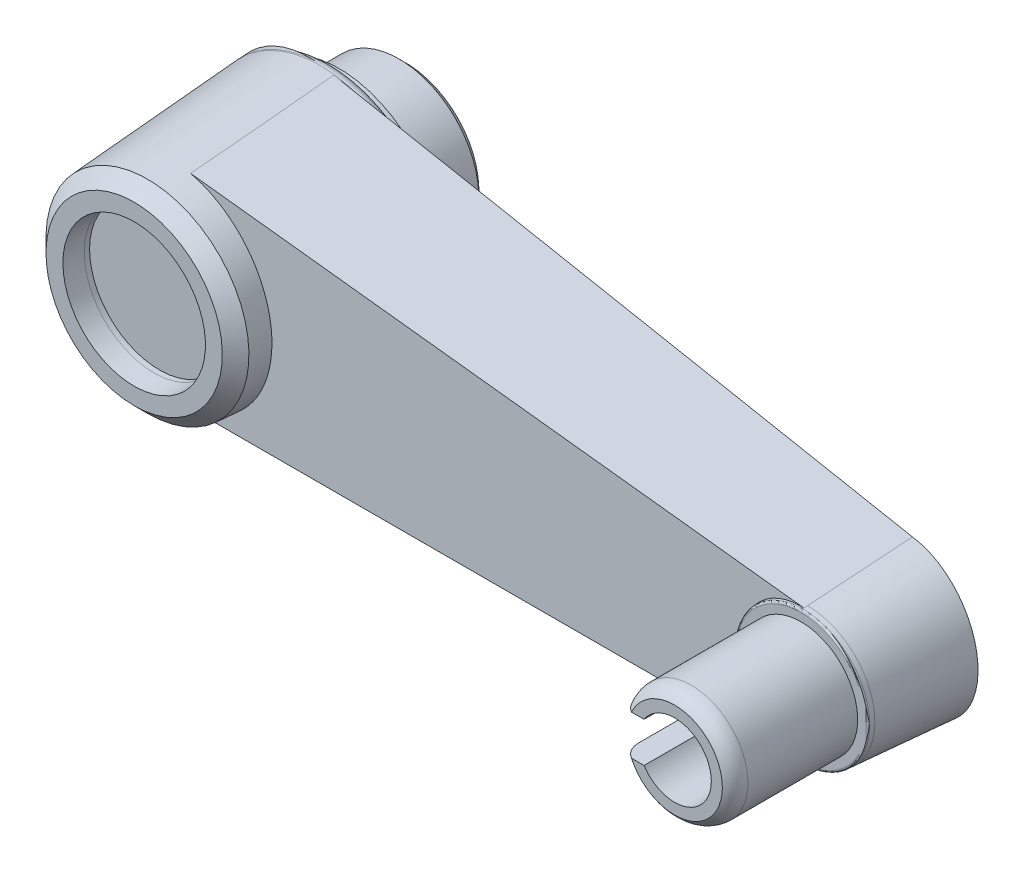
ISO-10303-21;
HEADER;
FILE_DESCRIPTION(('STEP AP214'),'2;1');
FILE_NAME('part.step','',(''),(''),'','','');
FILE_SCHEMA(('AUTOMOTIVE_DESIGN { 1 0 10303 214 1 1 1 1 }'));
ENDSEC;
DATA;
#1=APPLICATION_CONTEXT('core data for automotive mechanical design processes');
#2=APPLICATION_PROTOCOL_DEFINITION('international standard','automotive_design',2000,#1);
#3=PRODUCT_CONTEXT('',#1,'mechanical');
#4=PRODUCT('Part','Part','',(#3));
#5=PRODUCT_RELATED_PRODUCT_CATEGORY('part','',(#4));
#6=PRODUCT_DEFINITION_FORMATION('','',#4);
#7=PRODUCT_DEFINITION_CONTEXT('part definition',#1,'design');
#8=PRODUCT_DEFINITION('design','',#6,#7);
#9=PRODUCT_DEFINITION_SHAPE('','',#8);
#10=(LENGTH_UNIT() NAMED_UNIT(*) SI_UNIT(.MILLI.,.METRE.));
#11=(NAMED_UNIT(*) PLANE_ANGLE_UNIT() SI_UNIT($,.RADIAN.));
#12=(NAMED_UNIT(*) SI_UNIT($,.STERADIAN.) SOLID_ANGLE_UNIT());
#13=UNCERTAINTY_MEASURE_WITH_UNIT(LENGTH_MEASURE(1.E-05),#10,'distance_accuracy_value','');
#14=(GEOMETRIC_REPRESENTATION_CONTEXT(3) GLOBAL_UNCERTAINTY_ASSIGNED_CONTEXT((#13)) GLOBAL_UNIT_ASSIGNED_CONTEXT((#10,
#11,#12)) REPRESENTATION_CONTEXT('',''));
#15=CARTESIAN_POINT('',(0.,0.,0.));
#16=DIRECTION('',(0.,0.,1.));
#17=DIRECTION('',(1.,0.,0.));
#18=AXIS2_PLACEMENT_3D('',#15,#16,#17);
#19=CARTESIAN_POINT('',(100.,0.,47.0557830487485));
#20=DIRECTION('',(0.,0.,1.));
#21=DIRECTION('',(-1.,0.,0.));
#22=AXIS2_PLACEMENT_3D('',#19,#20,#21);
#23=CYLINDRICAL_SURFACE('',#22,5.5);
#24=CARTESIAN_POINT('',(100.,0.,59.5557830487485));
#25=DIRECTION('',(0.,0.,1.));
#26=DIRECTION('',(1.,0.,0.));
#27=AXIS2_PLACEMENT_3D('',#24,#25,#26);
#28=CIRCLE('',#27,5.5);
#29=CARTESIAN_POINT('',(95.390227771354,3.00000000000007,59.5557830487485));
#30=VERTEX_POINT('',#29);
#31=CARTESIAN_POINT('',(95.3902277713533,-2.99999999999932,59.5557830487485));
#32=VERTEX_POINT('',#31);
#33=EDGE_CURVE('E145',#30,#32,#28,.F.);
#34=ORIENTED_EDGE('',*,*,#33,.F.);
#35=DIRECTION('',(0.,0.,1.));
#36=VECTOR('',#35,1.);
#37=CARTESIAN_POINT('',(95.390227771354,3.00000000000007,47.0557830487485));
#38=LINE('',#37,#36);
#39=CARTESIAN_POINT('',(95.390227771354,3.00000000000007,47.0557830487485));
#40=VERTEX_POINT('',#39);
#41=EDGE_CURVE('E157',#40,#30,#38,.T.);
#42=ORIENTED_EDGE('',*,*,#41,.F.);
#43=CARTESIAN_POINT('',(100.,0.,47.0557830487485));
#44=DIRECTION('',(0.,0.,1.));
#45=DIRECTION('',(-1.,0.,0.));
#46=AXIS2_PLACEMENT_3D('',#43,#44,#45);
#47=CIRCLE('',#46,5.5);
#48=CARTESIAN_POINT('',(95.3902277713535,-2.99999999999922,47.0557830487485));
#49=VERTEX_POINT('',#48);
#50=EDGE_CURVE('E309',#49,#40,#47,.T.);
#51=ORIENTED_EDGE('',*,*,#50,.F.);
#52=DIRECTION('',(0.,0.,1.));
#53=VECTOR('',#52,1.);
#54=CARTESIAN_POINT('',(95.3902277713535,-2.99999999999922,47.0557830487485));
#55=LINE('',#54,#53);
#56=EDGE_CURVE('E159',#49,#32,#55,.T.);
#57=ORIENTED_EDGE('',*,*,#56,.T.);
#58=EDGE_LOOP('',(#34,#42,#51,#57));
#59=FACE_BOUND('',#58,.T.);
#60=CARTESIAN_POINT('',(100.,-5.5,49.0557830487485));
#61=CARTESIAN_POINT('',(99.8914568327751,-5.50000205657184,49.0557802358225));
#62=CARTESIAN_POINT('',(99.7829334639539,-5.49675838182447,49.0646472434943));
#63=CARTESIAN_POINT('',(99.5691172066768,-5.4841414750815,49.0997475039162));
#64=CARTESIAN_POINT('',(99.4638240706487,-5.47476871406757,49.1259794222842));
#65=CARTESIAN_POINT('',(99.2595820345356,-5.45090325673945,49.1947677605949));
#66=CARTESIAN_POINT('',(99.1606217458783,-5.43642007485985,49.2372938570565));
#67=CARTESIAN_POINT('',(98.9712437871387,-5.4037862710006,49.3373139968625));
#68=CARTESIAN_POINT('',(98.8808282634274,-5.3856347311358,49.3948117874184));
#69=CARTESIAN_POINT('',(98.7074630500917,-5.34673088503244,49.525567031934));
#70=CARTESIAN_POINT('',(98.6249038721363,-5.32590805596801,49.5993210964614));
#71=CARTESIAN_POINT('',(98.473016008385,-5.2843667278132,49.7594407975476));
#72=CARTESIAN_POINT('',(98.4036910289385,-5.26364825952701,49.8458099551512));
#73=CARTESIAN_POINT('',(98.2778295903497,-5.22385385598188,50.0324380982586));
#74=CARTESIAN_POINT('',(98.2218322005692,-5.20486193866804,50.1330803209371));
#75=CARTESIAN_POINT('',(98.1277306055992,-5.17176122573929,50.3431545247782));
#76=CARTESIAN_POINT('',(98.0896197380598,-5.15765061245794,50.4525832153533));
#77=CARTESIAN_POINT('',(98.0338932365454,-5.13666087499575,50.672641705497));
#78=CARTESIAN_POINT('',(98.0155358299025,-5.12952103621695,50.7830579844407));
#79=CARTESIAN_POINT('',(97.9975178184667,-5.12251577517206,51.0056168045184));
#80=CARTESIAN_POINT('',(97.9978500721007,-5.12264757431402,51.1177586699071));
#81=CARTESIAN_POINT('',(98.0166323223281,-5.12994485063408,51.3339352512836));
#82=CARTESIAN_POINT('',(98.0340714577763,-5.13671788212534,51.4380734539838));
#83=CARTESIAN_POINT('',(98.0849075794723,-5.15588510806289,51.641829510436));
#84=CARTESIAN_POINT('',(98.1183068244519,-5.16828009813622,51.7414467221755));
#85=CARTESIAN_POINT('',(98.2006995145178,-5.19754287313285,51.9354594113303));
#86=CARTESIAN_POINT('',(98.249965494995,-5.21448789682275,52.0297269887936));
#87=CARTESIAN_POINT('',(98.3625035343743,-5.25091385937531,52.2089578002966));
#88=CARTESIAN_POINT('',(98.4257802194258,-5.27039563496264,52.2939179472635));
#89=CARTESIAN_POINT('',(98.5692332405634,-5.31119569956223,52.4577427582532));
#90=CARTESIAN_POINT('',(98.650222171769,-5.33255243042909,52.5358879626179));
#91=CARTESIAN_POINT('',(98.824407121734,-5.37363749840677,52.677694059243));
#92=CARTESIAN_POINT('',(98.9176047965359,-5.39336561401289,52.7413529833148));
#93=CARTESIAN_POINT('',(99.1153085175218,-5.42932219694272,52.85311021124));
#94=CARTESIAN_POINT('',(99.219952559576,-5.44549875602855,52.9009822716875));
#95=CARTESIAN_POINT('',(99.436542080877,-5.4721472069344,52.9782081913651));
#96=CARTESIAN_POINT('',(99.5484844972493,-5.48262147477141,53.0075697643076));
#97=CARTESIAN_POINT('',(99.7704278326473,-5.49627428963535,53.0455890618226));
#98=CARTESIAN_POINT('',(99.8802418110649,-5.49979422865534,53.0552165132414));
#99=CARTESIAN_POINT('',(100.099959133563,-5.50018795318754,53.0563005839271));
#100=CARTESIAN_POINT('',(100.209862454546,-5.49706310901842,53.0477609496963));
#101=CARTESIAN_POINT('',(100.422536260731,-5.48474392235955,53.0134996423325));
#102=CARTESIAN_POINT('',(100.525421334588,-5.47577009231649,52.9884018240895));
#103=CARTESIAN_POINT('',(100.725457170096,-5.45287588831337,52.9225461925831));
#104=CARTESIAN_POINT('',(100.822607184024,-5.43895487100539,52.8817863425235));
#105=CARTESIAN_POINT('',(101.011530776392,-5.4070557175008,52.784487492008));
#106=CARTESIAN_POINT('',(101.103070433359,-5.38897272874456,52.7275296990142));
#107=CARTESIAN_POINT('',(101.275590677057,-5.35076522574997,52.599929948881));
#108=CARTESIAN_POINT('',(101.356567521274,-5.33063999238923,52.5292831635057));
#109=CARTESIAN_POINT('',(101.510271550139,-5.28921180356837,52.3717752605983));
#110=CARTESIAN_POINT('',(101.582308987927,-5.26790441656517,52.2842404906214));
#111=CARTESIAN_POINT('',(101.710794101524,-5.22759328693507,52.0978920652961));
#112=CARTESIAN_POINT('',(101.767240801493,-5.20858968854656,51.9990777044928));
#113=CARTESIAN_POINT('',(101.862891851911,-5.17515419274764,51.7924101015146));
#114=CARTESIAN_POINT('',(101.902059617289,-5.16073201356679,51.6845382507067));
#115=CARTESIAN_POINT('',(101.961439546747,-5.13846087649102,51.4630656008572));
#116=CARTESIAN_POINT('',(101.981662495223,-5.13060817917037,51.3494681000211));
#117=CARTESIAN_POINT('',(102.001647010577,-5.12284228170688,51.1271917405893));
#118=CARTESIAN_POINT('',(102.002575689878,-5.12247623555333,51.0186326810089));
#119=CARTESIAN_POINT('',(101.986902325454,-5.12857566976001,50.8029934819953));
#120=CARTESIAN_POINT('',(101.970301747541,-5.13504057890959,50.6959132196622));
#121=CARTESIAN_POINT('',(101.920928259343,-5.15370717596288,50.4891880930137));
#122=CARTESIAN_POINT('',(101.888603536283,-5.16574946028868,50.389420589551));
#123=CARTESIAN_POINT('',(101.809084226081,-5.19413013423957,50.1966602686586));
#124=CARTESIAN_POINT('',(101.761885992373,-5.21046957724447,50.1036691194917));
#125=CARTESIAN_POINT('',(101.651211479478,-5.24662240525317,49.9220415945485));
#126=CARTESIAN_POINT('',(101.587038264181,-5.26656880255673,49.8338566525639));
#127=CARTESIAN_POINT('',(101.445341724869,-5.30720401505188,49.6691328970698));
#128=CARTESIAN_POINT('',(101.367814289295,-5.32789305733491,49.5925976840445));
#129=CARTESIAN_POINT('',(101.197003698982,-5.36891606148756,49.4494835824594));
#130=CARTESIAN_POINT('',(101.10312945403,-5.38918141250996,49.3835875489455));
#131=CARTESIAN_POINT('',(100.904935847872,-5.42597802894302,49.2685459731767));
#132=CARTESIAN_POINT('',(100.800616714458,-5.44250937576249,49.2194000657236));
#133=CARTESIAN_POINT('',(100.582422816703,-5.47019903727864,49.1388733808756));
#134=CARTESIAN_POINT('',(100.468408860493,-5.48125425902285,49.107831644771));
#135=CARTESIAN_POINT('',(100.236254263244,-5.49615207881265,49.0662924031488));
#136=CARTESIAN_POINT('',(100.118115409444,-5.49999776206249,49.0557861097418));
#137=CARTESIAN_POINT('',(100.,-5.5,49.0557830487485));
#138=B_SPLINE_CURVE_WITH_KNOTS('',3,(#60,#61,#62,#63,#64,#65,#66,#67,#68,#69,#70,#71,#72,#73,
#74,#75,#76,#77,#78,#79,#80,#81,#82,#83,#84,#85,#86,#87,#88,#89,#90,#91,#92,#93,#94,#95,#96,#97,
#98,#99,#100,#101,#102,#103,#104,#105,#106,#107,#108,#109,#110,#111,#112,#113,#114,#115,#116,
#117,#118,#119,#120,#121,#122,#123,#124,#125,#126,#127,#128,#129,#130,#131,#132,#133,#134,#135,
#136,#137),.UNSPECIFIED.,.T.,.F.,(4,2,2,2,2,2,2,2,2,2,2,2,2,2,2,2,2,2,2,2,2,2,2,2,2,2,2,2,2,2,2,
2,2,2,2,2,2,2,4),(0.,0.325194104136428,0.65036322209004,0.974930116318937,1.2995783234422,
1.63601964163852,1.97255504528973,2.32099392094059,2.66930290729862,3.00401939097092,
3.3386079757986,3.65454759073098,3.97053193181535,4.29226244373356,4.61409934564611,
4.95617818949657,5.29830348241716,5.64513792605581,5.99182774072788,6.32102805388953,
6.65016048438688,6.96755079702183,7.28498239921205,7.611512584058,7.93815814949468,
8.28259860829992,8.62706062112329,8.97224851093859,9.31723978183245,9.6412974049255,
9.96532793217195,10.2806204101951,10.5959902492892,10.9271566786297,11.2584252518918,
11.6061385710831,11.9538443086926,12.3078682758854,12.6617407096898),.UNSPECIFIED.);
#139=CARTESIAN_POINT('',(100.,-5.5,49.0557830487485));
#140=VERTEX_POINT('',#139);
#141=EDGE_CURVE('E28',#140,#140,#138,.T.);
#142=ORIENTED_EDGE('',*,*,#141,.F.);
#143=EDGE_LOOP('',(#142));
#144=FACE_BOUND('',#143,.T.);
#145=CARTESIAN_POINT('',(100.,5.5,49.0557830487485));
#146=CARTESIAN_POINT('',(100.108543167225,5.50000205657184,49.0557802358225));
#147=CARTESIAN_POINT('',(100.217066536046,5.49675838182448,49.0646472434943));
#148=CARTESIAN_POINT('',(100.430882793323,5.4841414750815,49.0997475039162));
#149=CARTESIAN_POINT('',(100.536175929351,5.47476871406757,49.1259794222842));
#150=CARTESIAN_POINT('',(100.740417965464,5.45090325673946,49.1947677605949));
#151=CARTESIAN_POINT('',(100.839378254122,5.43642007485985,49.2372938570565));
#152=CARTESIAN_POINT('',(101.028756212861,5.40378627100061,49.3373139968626));
#153=CARTESIAN_POINT('',(101.119171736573,5.38563473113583,49.3948117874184));
#154=CARTESIAN_POINT('',(101.292536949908,5.34673088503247,49.525567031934));
#155=CARTESIAN_POINT('',(101.375096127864,5.32590805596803,49.5993210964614));
#156=CARTESIAN_POINT('',(101.526983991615,5.28436672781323,49.7594407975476));
#157=CARTESIAN_POINT('',(101.596308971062,5.26364825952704,49.8458099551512));
#158=CARTESIAN_POINT('',(101.72217040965,5.22385385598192,50.0324380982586));
#159=CARTESIAN_POINT('',(101.778167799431,5.20486193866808,50.1330803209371));
#160=CARTESIAN_POINT('',(101.872269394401,5.17176122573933,50.3431545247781));
#161=CARTESIAN_POINT('',(101.91038026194,5.15765061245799,50.4525832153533));
#162=CARTESIAN_POINT('',(101.966106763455,5.13666087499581,50.672641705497));
#163=CARTESIAN_POINT('',(101.984464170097,5.129521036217,50.7830579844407));
#164=CARTESIAN_POINT('',(102.002482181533,5.12251577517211,51.0056168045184));
#165=CARTESIAN_POINT('',(102.002149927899,5.12264757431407,51.1177586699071));
#166=CARTESIAN_POINT('',(101.983367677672,5.12994485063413,51.3339352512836));
#167=CARTESIAN_POINT('',(101.965928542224,5.1367178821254,51.4380734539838));
#168=CARTESIAN_POINT('',(101.915092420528,5.15588510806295,51.641829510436));
#169=CARTESIAN_POINT('',(101.881693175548,5.16828009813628,51.7414467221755));
#170=CARTESIAN_POINT('',(101.799300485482,5.19754287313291,51.9354594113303));
#171=CARTESIAN_POINT('',(101.750034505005,5.21448789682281,52.0297269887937));
#172=CARTESIAN_POINT('',(101.637496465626,5.25091385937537,52.2089578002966));
#173=CARTESIAN_POINT('',(101.574219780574,5.2703956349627,52.2939179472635));
#174=CARTESIAN_POINT('',(101.430766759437,5.31119569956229,52.4577427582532));
#175=CARTESIAN_POINT('',(101.349777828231,5.33255243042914,52.5358879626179));
#176=CARTESIAN_POINT('',(101.175592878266,5.37363749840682,52.6776940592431));
#177=CARTESIAN_POINT('',(101.082395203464,5.39336561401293,52.7413529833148));
#178=CARTESIAN_POINT('',(100.884691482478,5.42932219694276,52.85311021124));
#179=CARTESIAN_POINT('',(100.780047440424,5.44549875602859,52.9009822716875));
#180=CARTESIAN_POINT('',(100.563457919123,5.47214720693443,52.9782081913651));
#181=CARTESIAN_POINT('',(100.451515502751,5.48262147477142,53.0075697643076));
#182=CARTESIAN_POINT('',(100.229572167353,5.49627428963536,53.0455890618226));
#183=CARTESIAN_POINT('',(100.119758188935,5.49979422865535,53.0552165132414));
#184=CARTESIAN_POINT('',(99.9000408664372,5.50018795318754,53.0563005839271));
#185=CARTESIAN_POINT('',(99.7901375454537,5.49706310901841,53.0477609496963));
#186=CARTESIAN_POINT('',(99.5774637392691,5.48474392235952,53.0134996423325));
#187=CARTESIAN_POINT('',(99.4745786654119,5.47577009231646,52.9884018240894));
#188=CARTESIAN_POINT('',(99.2745428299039,5.45287588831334,52.9225461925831));
#189=CARTESIAN_POINT('',(99.1773928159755,5.43895487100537,52.8817863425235));
#190=CARTESIAN_POINT('',(98.9884692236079,5.40705571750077,52.784487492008));
#191=CARTESIAN_POINT('',(98.8969295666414,5.38897272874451,52.7275296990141));
#192=CARTESIAN_POINT('',(98.7244093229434,5.35076522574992,52.5999299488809));
#193=CARTESIAN_POINT('',(98.6434324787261,5.33063999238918,52.5292831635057));
#194=CARTESIAN_POINT('',(98.4897284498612,5.28921180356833,52.3717752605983));
#195=CARTESIAN_POINT('',(98.4176910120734,5.2679044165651,52.2842404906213));
#196=CARTESIAN_POINT('',(98.2892058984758,5.22759328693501,52.0978920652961));
#197=CARTESIAN_POINT('',(98.2327591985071,5.2085896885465,51.9990777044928));
#198=CARTESIAN_POINT('',(98.1371081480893,5.17515419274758,51.7924101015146));
#199=CARTESIAN_POINT('',(98.0979403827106,5.16073201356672,51.6845382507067));
#200=CARTESIAN_POINT('',(98.0385604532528,5.13846087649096,51.4630656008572));
#201=CARTESIAN_POINT('',(98.0183375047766,5.13060817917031,51.3494681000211));
#202=CARTESIAN_POINT('',(97.9983529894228,5.12284228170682,51.1271917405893));
#203=CARTESIAN_POINT('',(97.9974243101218,5.12247623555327,51.0186326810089));
#204=CARTESIAN_POINT('',(98.0130976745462,5.12857566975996,50.8029934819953));
#205=CARTESIAN_POINT('',(98.0296982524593,5.13504057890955,50.6959132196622));
#206=CARTESIAN_POINT('',(98.0790717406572,5.15370717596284,50.4891880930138));
#207=CARTESIAN_POINT('',(98.1113964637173,5.16574946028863,50.389420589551));
#208=CARTESIAN_POINT('',(98.1909157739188,5.19413013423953,50.1966602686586));
#209=CARTESIAN_POINT('',(98.2381140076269,5.21046957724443,50.1036691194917));
#210=CARTESIAN_POINT('',(98.3487885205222,5.24662240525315,49.9220415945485));
#211=CARTESIAN_POINT('',(98.4129617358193,5.26656880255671,49.8338566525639));
#212=CARTESIAN_POINT('',(98.5546582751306,5.30720401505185,49.6691328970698));
#213=CARTESIAN_POINT('',(98.6321857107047,5.32789305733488,49.5925976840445));
#214=CARTESIAN_POINT('',(98.8029963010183,5.36891606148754,49.4494835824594));
#215=CARTESIAN_POINT('',(98.8968705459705,5.38918141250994,49.3835875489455));
#216=CARTESIAN_POINT('',(99.0950641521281,5.42597802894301,49.2685459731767));
#217=CARTESIAN_POINT('',(99.1993832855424,5.44250937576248,49.2194000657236));
#218=CARTESIAN_POINT('',(99.4175771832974,5.47019903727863,49.1388733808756));
#219=CARTESIAN_POINT('',(99.5315911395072,5.48125425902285,49.107831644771));
#220=CARTESIAN_POINT('',(99.7637457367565,5.49615207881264,49.0662924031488));
#221=CARTESIAN_POINT('',(99.8818845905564,5.49999776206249,49.0557861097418));
#222=CARTESIAN_POINT('',(100.,5.5,49.0557830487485));
#223=B_SPLINE_CURVE_WITH_KNOTS('',3,(#145,#146,#147,#148,#149,#150,#151,#152,#153,#154,#155,
#156,#157,#158,#159,#160,#161,#162,#163,#164,#165,#166,#167,#168,#169,#170,#171,#172,#173,#174,
#175,#176,#177,#178,#179,#180,#181,#182,#183,#184,#185,#186,#187,#188,#189,#190,#191,#192,#193,
#194,#195,#196,#197,#198,#199,#200,#201,#202,#203,#204,#205,#206,#207,#208,#209,#210,#211,#212,
#213,#214,#215,#216,#217,#218,#219,#220,#221,#222),.UNSPECIFIED.,.T.,.F.,(4,2,2,2,2,2,2,2,2,2,2,
2,2,2,2,2,2,2,2,2,2,2,2,2,2,2,2,2,2,2,2,2,2,2,2,2,2,2,4),(0.,0.325194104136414,
0.650363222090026,0.974930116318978,1.29957832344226,1.63601964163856,1.97255504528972,
2.32099392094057,2.66930290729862,3.00401939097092,3.33860797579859,3.65454759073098,
3.97053193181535,4.29226244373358,4.61409934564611,4.95617818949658,5.29830348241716,
5.64513792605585,5.99182774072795,6.32102805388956,6.65016048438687,6.96755079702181,
7.28498239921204,7.61151258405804,7.93815814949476,8.28259860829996,8.6270606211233,
8.97224851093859,9.31723978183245,9.64129740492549,9.96532793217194,10.2806204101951,
10.5959902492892,10.9271566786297,11.2584252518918,11.6061385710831,11.9538443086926,
12.3078682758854,12.6617407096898),.UNSPECIFIED.);
#224=CARTESIAN_POINT('',(100.,5.5,49.0557830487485));
#225=VERTEX_POINT('',#224);
#226=EDGE_CURVE('E9',#225,#225,#223,.T.);
#227=ORIENTED_EDGE('',*,*,#226,.F.);
#228=EDGE_LOOP('',(#227));
#229=FACE_BOUND('',#228,.T.);
#230=ADVANCED_FACE('F14',(#59,#144,#229),#23,.F.);
#231=CARTESIAN_POINT('',(100.,0.,57.0557830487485));
#232=DIRECTION('',(0.,0.,1.));
#233=DIRECTION('',(-1.,0.,0.));
#234=AXIS2_PLACEMENT_3D('',#231,#232,#233);
#235=TOROIDAL_SURFACE('',#234,5.50000000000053,3.);
#236=CARTESIAN_POINT('',(92.8966823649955,3.00000000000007,59.0836309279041));
#237=CARTESIAN_POINT('',(92.9610453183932,3.00000000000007,59.1482696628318));
#238=CARTESIAN_POINT('',(93.0283499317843,3.00000000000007,59.2100369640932));
#239=CARTESIAN_POINT('',(93.1681735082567,3.00000000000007,59.32741814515));
#240=CARTESIAN_POINT('',(93.2406962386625,3.00000000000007,59.3830275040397));
#241=CARTESIAN_POINT('',(93.3904528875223,3.00000000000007,59.487914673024));
#242=CARTESIAN_POINT('',(93.4676977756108,3.00000000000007,59.5371768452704));
#243=CARTESIAN_POINT('',(93.6260696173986,3.00000000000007,59.6290309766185));
#244=CARTESIAN_POINT('',(93.7071982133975,3.00000000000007,59.6716200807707));
#245=CARTESIAN_POINT('',(93.9544451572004,3.00000000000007,59.7887180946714));
#246=CARTESIAN_POINT('',(94.1254089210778,3.00000000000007,59.8532383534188));
#247=CARTESIAN_POINT('',(94.4748831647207,3.00000000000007,59.9554316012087));
#248=CARTESIAN_POINT('',(94.6533902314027,3.00000000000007,59.9931165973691));
#249=CARTESIAN_POINT('',(95.0320529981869,3.00000000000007,60.0455285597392));
#250=CARTESIAN_POINT('',(95.2325773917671,3.00000000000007,60.0575590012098));
#251=CARTESIAN_POINT('',(95.6331751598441,3.00000000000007,60.0535823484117));
#252=CARTESIAN_POINT('',(95.8332485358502,3.00000000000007,60.0375753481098));
#253=CARTESIAN_POINT('',(96.2039010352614,3.00000000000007,59.985009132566));
#254=CARTESIAN_POINT('',(96.3749218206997,3.00000000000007,59.9514046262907));
#255=CARTESIAN_POINT('',(96.7132294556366,3.00000000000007,59.8687368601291));
#256=CARTESIAN_POINT('',(96.8805138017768,3.00000000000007,59.8196635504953));
#257=CARTESIAN_POINT('',(97.2115124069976,3.00000000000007,59.7090951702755));
#258=CARTESIAN_POINT('',(97.3752114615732,3.00000000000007,59.6475555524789));
#259=CARTESIAN_POINT('',(97.6990085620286,3.00000000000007,59.5158886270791));
#260=CARTESIAN_POINT('',(97.8591071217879,3.00000000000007,59.4457625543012));
#261=CARTESIAN_POINT('',(98.1239918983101,3.00000000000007,59.3258142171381));
#262=CARTESIAN_POINT('',(98.2292885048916,3.00000000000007,59.2770868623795));
#263=CARTESIAN_POINT('',(98.4399712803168,3.00000000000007,59.1797120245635));
#264=CARTESIAN_POINT('',(98.5453574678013,3.00000000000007,59.1310645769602));
#265=CARTESIAN_POINT('',(98.7571383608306,3.00000000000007,59.0363920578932));
#266=CARTESIAN_POINT('',(98.8635314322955,3.00000000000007,58.9903633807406));
#267=CARTESIAN_POINT('',(99.0787781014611,3.00000000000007,58.9044123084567));
#268=CARTESIAN_POINT('',(99.1876295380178,3.00000000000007,58.8644847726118));
#269=CARTESIAN_POINT('',(99.3627757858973,3.00000000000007,58.8101116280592));
#270=CARTESIAN_POINT('',(99.427905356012,3.00000000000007,58.7919803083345));
#271=CARTESIAN_POINT('',(99.5593425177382,3.00000000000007,58.7607362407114));
#272=CARTESIAN_POINT('',(99.6256493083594,3.00000000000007,58.7476202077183));
#273=CARTESIAN_POINT('',(99.7586575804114,3.00000000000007,58.727586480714));
#274=CARTESIAN_POINT('',(99.8253512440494,3.00000000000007,58.720618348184));
#275=CARTESIAN_POINT('',(99.9591052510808,3.00000000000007,58.713399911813));
#276=CARTESIAN_POINT('',(100.026165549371,3.00000000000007,58.7131487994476));
#277=CARTESIAN_POINT('',(100.159855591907,3.00000000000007,58.7193842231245));
#278=CARTESIAN_POINT('',(100.226485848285,3.00000000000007,58.7258601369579));
#279=CARTESIAN_POINT('',(100.358880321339,3.00000000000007,58.7448809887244));
#280=CARTESIAN_POINT('',(100.424644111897,3.00000000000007,58.7574288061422));
#281=CARTESIAN_POINT('',(100.555833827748,3.00000000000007,58.7877217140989));
#282=CARTESIAN_POINT('',(100.621244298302,3.00000000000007,58.8055321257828));
#283=CARTESIAN_POINT('',(100.75082899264,3.00000000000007,58.8450792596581));
#284=CARTESIAN_POINT('',(100.815003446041,3.00000000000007,58.8668152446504));
#285=CARTESIAN_POINT('',(100.948489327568,3.00000000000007,58.9153754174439));
#286=CARTESIAN_POINT('',(101.017693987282,3.00000000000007,58.9424887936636));
#287=CARTESIAN_POINT('',(101.155189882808,3.00000000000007,58.9989500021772));
#288=CARTESIAN_POINT('',(101.22348090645,3.00000000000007,59.0282983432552));
#289=CARTESIAN_POINT('',(101.35954959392,3.00000000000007,59.0883159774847));
#290=CARTESIAN_POINT('',(101.427326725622,3.00000000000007,59.1189864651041));
#291=CARTESIAN_POINT('',(101.562624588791,3.00000000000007,59.1808900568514));
#292=CARTESIAN_POINT('',(101.630145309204,3.00000000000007,59.2121231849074));
#293=CARTESIAN_POINT('',(101.83310963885,3.00000000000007,59.3059190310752));
#294=CARTESIAN_POINT('',(101.968588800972,3.00000000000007,59.3684081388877));
#295=CARTESIAN_POINT('',(102.241263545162,3.00000000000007,59.4895327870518));
#296=CARTESIAN_POINT('',(102.37845870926,3.00000000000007,59.5481692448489));
#297=CARTESIAN_POINT('',(102.585042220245,3.00000000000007,59.6307264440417));
#298=CARTESIAN_POINT('',(102.653431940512,3.00000000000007,59.657137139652));
#299=CARTESIAN_POINT('',(102.790904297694,3.00000000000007,59.7080963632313));
#300=CARTESIAN_POINT('',(102.859986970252,3.00000000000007,59.7326447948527));
#301=CARTESIAN_POINT('',(103.068367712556,3.00000000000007,59.803103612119));
#302=CARTESIAN_POINT('',(103.208774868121,3.00000000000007,59.8458178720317));
#303=CARTESIAN_POINT('',(103.49200488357,3.00000000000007,59.9206434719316));
#304=CARTESIAN_POINT('',(103.634820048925,3.00000000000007,59.9527836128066));
#305=CARTESIAN_POINT('',(103.922619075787,3.00000000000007,60.0048439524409));
#306=CARTESIAN_POINT('',(104.067601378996,3.00000000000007,60.0247725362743));
#307=CARTESIAN_POINT('',(104.322430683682,3.00000000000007,60.0475981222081));
#308=CARTESIAN_POINT('',(104.43201073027,3.00000000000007,60.0535054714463));
#309=CARTESIAN_POINT('',(104.651313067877,3.00000000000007,60.0569790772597));
#310=CARTESIAN_POINT('',(104.761035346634,3.00000000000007,60.0545460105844));
#311=CARTESIAN_POINT('',(104.980829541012,3.00000000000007,60.0407674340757));
#312=CARTESIAN_POINT('',(105.090897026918,3.00000000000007,60.0293495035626));
#313=CARTESIAN_POINT('',(105.309638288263,3.00000000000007,59.9970870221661));
#314=CARTESIAN_POINT('',(105.418312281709,3.00000000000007,59.9762439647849));
#315=CARTESIAN_POINT('',(105.634036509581,3.00000000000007,59.9246567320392));
#316=CARTESIAN_POINT('',(105.741071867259,3.00000000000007,59.8938499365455));
#317=CARTESIAN_POINT('',(105.951682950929,3.00000000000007,59.8222210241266));
#318=CARTESIAN_POINT('',(106.055260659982,3.00000000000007,59.7814047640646));
#319=CARTESIAN_POINT('',(106.257601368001,3.00000000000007,59.689866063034));
#320=CARTESIAN_POINT('',(106.356377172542,3.00000000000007,59.6391720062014));
#321=CARTESIAN_POINT('',(106.548240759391,3.00000000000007,59.5279719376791));
#322=CARTESIAN_POINT('',(106.641329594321,3.00000000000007,59.4674677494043));
#323=CARTESIAN_POINT('',(106.808235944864,3.00000000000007,59.3460229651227));
#324=CARTESIAN_POINT('',(106.882939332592,3.00000000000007,59.2862969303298));
#325=CARTESIAN_POINT('',(107.026475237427,3.00000000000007,59.1601719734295));
#326=CARTESIAN_POINT('',(107.095308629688,3.00000000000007,59.093774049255));
#327=CARTESIAN_POINT('',(107.226388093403,3.00000000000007,58.9547307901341));
#328=CARTESIAN_POINT('',(107.288633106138,3.00000000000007,58.8820844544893));
#329=CARTESIAN_POINT('',(107.405808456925,3.00000000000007,58.7311532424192));
#330=CARTESIAN_POINT('',(107.460739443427,3.00000000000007,58.6528688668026));
#331=CARTESIAN_POINT('',(107.602646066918,3.00000000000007,58.4278404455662));
#332=CARTESIAN_POINT('',(107.681006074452,3.00000000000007,58.2755168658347));
#333=CARTESIAN_POINT('',(107.809259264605,3.00000000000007,57.9594685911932));
#334=CARTESIAN_POINT('',(107.859169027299,3.00000000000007,57.7957505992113));
#335=CARTESIAN_POINT('',(107.92674704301,3.00000000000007,57.4711595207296));
#336=CARTESIAN_POINT('',(107.946033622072,3.00000000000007,57.3106229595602));
#337=CARTESIAN_POINT('',(107.956801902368,3.00000000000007,56.9886285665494));
#338=CARTESIAN_POINT('',(107.94828691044,3.00000000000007,56.8271708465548));
#339=CARTESIAN_POINT('',(107.904202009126,3.00000000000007,56.5111594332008));
#340=CARTESIAN_POINT('',(107.86915198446,3.00000000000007,56.3565327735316));
#341=CARTESIAN_POINT('',(107.773840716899,3.00000000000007,56.0552741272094));
#342=CARTESIAN_POINT('',(107.713579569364,3.00000000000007,55.9086421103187));
#343=CARTESIAN_POINT('',(107.569150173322,3.00000000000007,55.6257910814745));
#344=CARTESIAN_POINT('',(107.484743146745,3.00000000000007,55.4896942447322));
#345=CARTESIAN_POINT('',(107.295080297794,3.00000000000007,55.2329378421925));
#346=CARTESIAN_POINT('',(107.189822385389,3.00000000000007,55.1122798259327));
#347=CARTESIAN_POINT('',(106.957275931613,3.00000000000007,54.8846090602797));
#348=CARTESIAN_POINT('',(106.829288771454,3.00000000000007,54.7783111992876));
#349=CARTESIAN_POINT('',(106.558297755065,3.00000000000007,54.5870508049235));
#350=CARTESIAN_POINT('',(106.415290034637,3.00000000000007,54.5020937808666));
#351=CARTESIAN_POINT('',(106.107594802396,3.00000000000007,54.3491696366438));
#352=CARTESIAN_POINT('',(105.942088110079,3.00000000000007,54.2828556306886));
#353=CARTESIAN_POINT('',(105.603047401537,3.00000000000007,54.175812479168));
#354=CARTESIAN_POINT('',(105.429510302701,3.00000000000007,54.1350932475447));
#355=CARTESIAN_POINT('',(105.058147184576,3.00000000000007,54.0749348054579));
#356=CARTESIAN_POINT('',(104.859838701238,3.00000000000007,54.058511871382));
#357=CARTESIAN_POINT('',(104.463115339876,3.00000000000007,54.053682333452));
#358=CARTESIAN_POINT('',(104.264700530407,3.00000000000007,54.0652651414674));
#359=CARTESIAN_POINT('',(103.902605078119,3.00000000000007,54.1090238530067));
#360=CARTESIAN_POINT('',(103.73846057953,3.00000000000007,54.1375963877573));
#361=CARTESIAN_POINT('',(103.413369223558,3.00000000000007,54.2095161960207));
#362=CARTESIAN_POINT('',(103.252424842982,3.00000000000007,54.252874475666));
#363=CARTESIAN_POINT('',(102.933084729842,3.00000000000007,54.3520157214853));
#364=CARTESIAN_POINT('',(102.774719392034,3.00000000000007,54.4078946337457));
#365=CARTESIAN_POINT('',(102.461663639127,3.00000000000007,54.5286764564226));
#366=CARTESIAN_POINT('',(102.306970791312,3.00000000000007,54.5935731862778));
#367=CARTESIAN_POINT('',(102.007349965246,3.00000000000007,54.7254431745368));
#368=CARTESIAN_POINT('',(101.862309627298,3.00000000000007,54.7921673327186));
#369=CARTESIAN_POINT('',(101.644753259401,3.00000000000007,54.8926839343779));
#370=CARTESIAN_POINT('',(101.572152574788,3.00000000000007,54.9262996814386));
#371=CARTESIAN_POINT('',(101.426663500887,3.00000000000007,54.9928992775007));
#372=CARTESIAN_POINT('',(101.35377511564,3.00000000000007,55.0258831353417));
#373=CARTESIAN_POINT('',(101.208558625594,3.00000000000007,55.0897516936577));
#374=CARTESIAN_POINT('',(101.136242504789,3.00000000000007,55.1206627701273));
#375=CARTESIAN_POINT('',(100.99055110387,3.00000000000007,55.1798568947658));
#376=CARTESIAN_POINT('',(100.917175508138,3.00000000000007,55.2081391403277));
#377=CARTESIAN_POINT('',(100.695357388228,3.00000000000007,55.2866541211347));
#378=CARTESIAN_POINT('',(100.544472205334,3.00000000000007,55.330918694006));
#379=CARTESIAN_POINT('',(100.327497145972,3.00000000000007,55.3718078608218));
#380=CARTESIAN_POINT('',(100.263837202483,3.00000000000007,55.3811346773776));
#381=CARTESIAN_POINT('',(100.135883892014,3.00000000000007,55.3938428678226));
#382=CARTESIAN_POINT('',(100.071590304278,3.00000000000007,55.3972220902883));
#383=CARTESIAN_POINT('',(99.9430194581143,3.00000000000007,55.3976924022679));
#384=CARTESIAN_POINT('',(99.8787422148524,3.00000000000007,55.3947874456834));
#385=CARTESIAN_POINT('',(99.7507772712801,3.00000000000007,55.3829909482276));
#386=CARTESIAN_POINT('',(99.6870894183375,3.00000000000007,55.3741010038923));
#387=CARTESIAN_POINT('',(99.4857823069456,3.00000000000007,55.3374650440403));
#388=CARTESIAN_POINT('',(99.3499710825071,3.00000000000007,55.2998576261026));
#389=CARTESIAN_POINT('',(99.1500674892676,3.00000000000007,55.2325992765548));
#390=CARTESIAN_POINT('',(99.0839325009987,3.00000000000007,55.2083089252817));
#391=CARTESIAN_POINT('',(98.9526342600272,3.00000000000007,55.1572127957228));
#392=CARTESIAN_POINT('',(98.8874708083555,3.00000000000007,55.1304075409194));
#393=CARTESIAN_POINT('',(98.7567056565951,3.00000000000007,55.074706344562));
#394=CARTESIAN_POINT('',(98.6911163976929,3.00000000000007,55.045781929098));
#395=CARTESIAN_POINT('',(98.5603456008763,3.00000000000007,54.9870212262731));
#396=CARTESIAN_POINT('',(98.4951640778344,3.00000000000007,54.9571849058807));
#397=CARTESIAN_POINT('',(98.3000512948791,3.00000000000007,54.8673497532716));
#398=CARTESIAN_POINT('',(98.1703215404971,3.00000000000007,54.8069211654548));
#399=CARTESIAN_POINT('',(97.875681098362,3.00000000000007,54.6731037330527));
#400=CARTESIAN_POINT('',(97.7104270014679,3.00000000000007,54.6004495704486));
#401=CARTESIAN_POINT('',(97.3760275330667,3.00000000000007,54.4642174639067));
#402=CARTESIAN_POINT('',(97.2068802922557,3.00000000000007,54.4006439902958));
#403=CARTESIAN_POINT('',(96.8657399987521,3.00000000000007,54.2872615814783));
#404=CARTESIAN_POINT('',(96.6937894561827,3.00000000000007,54.2373271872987));
#405=CARTESIAN_POINT('',(96.3459369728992,3.00000000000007,54.153942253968));
#406=CARTESIAN_POINT('',(96.170038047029,3.00000000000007,54.1204795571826));
#407=CARTESIAN_POINT('',(95.8834758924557,3.00000000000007,54.0821535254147));
#408=CARTESIAN_POINT('',(95.7736067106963,3.00000000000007,54.0712462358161));
#409=CARTESIAN_POINT('',(95.5533754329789,3.00000000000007,54.0575096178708));
#410=CARTESIAN_POINT('',(95.4430134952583,3.00000000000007,54.0546778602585));
#411=CARTESIAN_POINT('',(95.2221707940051,3.00000000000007,54.0576690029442));
#412=CARTESIAN_POINT('',(95.1116902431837,3.00000000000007,54.0635094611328));
#413=CARTESIAN_POINT('',(94.8916344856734,3.00000000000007,54.0843623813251));
#414=CARTESIAN_POINT('',(94.7820588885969,3.00000000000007,54.0993706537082));
#415=CARTESIAN_POINT('',(94.5637008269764,3.00000000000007,54.1391097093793));
#416=CARTESIAN_POINT('',(94.4549331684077,3.00000000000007,54.1639225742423));
#417=CARTESIAN_POINT('',(94.240206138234,3.00000000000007,54.2235156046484));
#418=CARTESIAN_POINT('',(94.13424540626,3.00000000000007,54.2582908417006));
#419=CARTESIAN_POINT('',(93.9262094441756,3.00000000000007,54.3379110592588));
#420=CARTESIAN_POINT('',(93.8241327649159,3.00000000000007,54.3827522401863));
#421=CARTESIAN_POINT('',(93.6249941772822,3.00000000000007,54.4824530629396));
#422=CARTESIAN_POINT('',(93.5279314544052,3.00000000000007,54.5373110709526));
#423=CARTESIAN_POINT('',(93.3513771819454,3.00000000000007,54.6495765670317));
#424=CARTESIAN_POINT('',(93.2711794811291,3.00000000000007,54.7058754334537));
#425=CARTESIAN_POINT('',(93.1164121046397,3.00000000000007,54.8257312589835));
#426=CARTESIAN_POINT('',(93.0418415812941,3.00000000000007,54.8892871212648));
#427=CARTESIAN_POINT('',(92.8991658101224,3.00000000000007,55.0232275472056));
#428=CARTESIAN_POINT('',(92.8310570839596,3.00000000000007,55.0936083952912));
#429=CARTESIAN_POINT('',(92.7020589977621,3.00000000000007,55.2406580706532));
#430=CARTESIAN_POINT('',(92.6411688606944,3.00000000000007,55.3173262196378));
#431=CARTESIAN_POINT('',(92.4836487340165,3.00000000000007,55.5373878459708));
#432=CARTESIAN_POINT('',(92.3953661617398,3.00000000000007,55.6869105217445));
#433=CARTESIAN_POINT('',(92.2471456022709,3.00000000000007,55.999285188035));
#434=CARTESIAN_POINT('',(92.1871950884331,3.00000000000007,56.1621312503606));
#435=CARTESIAN_POINT('',(92.1007221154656,3.00000000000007,56.4856928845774));
#436=CARTESIAN_POINT('',(92.0723626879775,3.00000000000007,56.6459181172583));
#437=CARTESIAN_POINT('',(92.043687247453,3.00000000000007,56.9688279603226));
#438=CARTESIAN_POINT('',(92.0433629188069,3.00000000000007,57.1315118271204));
#439=CARTESIAN_POINT('',(92.0704095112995,3.00000000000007,57.4505448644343));
#440=CARTESIAN_POINT('',(92.0971061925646,3.00000000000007,57.6069518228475));
#441=CARTESIAN_POINT('',(92.1762631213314,3.00000000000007,57.9131853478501));
#442=CARTESIAN_POINT('',(92.2287365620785,3.00000000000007,58.0630085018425));
#443=CARTESIAN_POINT('',(92.3580485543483,3.00000000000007,58.3528747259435));
#444=CARTESIAN_POINT('',(92.4350460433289,3.00000000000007,58.492846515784));
#445=CARTESIAN_POINT('',(92.6106251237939,3.00000000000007,58.7581815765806));
#446=CARTESIAN_POINT('',(92.7091588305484,3.00000000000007,58.883576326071));
#447=CARTESIAN_POINT('',(92.8428833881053,3.00000000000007,59.0285639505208));
#448=CARTESIAN_POINT('',(92.8695209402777,3.00000000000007,59.0563531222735));
#449=CARTESIAN_POINT('',(92.8966823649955,3.00000000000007,59.0836309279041));
#450=B_SPLINE_CURVE_WITH_KNOTS('',3,(#236,#237,#238,#239,#240,#241,#242,#243,#244,#245,#246,
#247,#248,#249,#250,#251,#252,#253,#254,#255,#256,#257,#258,#259,#260,#261,#262,#263,#264,#265,
#266,#267,#268,#269,#270,#271,#272,#273,#274,#275,#276,#277,#278,#279,#280,#281,#282,#283,#284,
#285,#286,#287,#288,#289,#290,#291,#292,#293,#294,#295,#296,#297,#298,#299,#300,#301,#302,#303,
#304,#305,#306,#307,#308,#309,#310,#311,#312,#313,#314,#315,#316,#317,#318,#319,#320,#321,#322,
#323,#324,#325,#326,#327,#328,#329,#330,#331,#332,#333,#334,#335,#336,#337,#338,#339,#340,#341,
#342,#343,#344,#345,#346,#347,#348,#349,#350,#351,#352,#353,#354,#355,#356,#357,#358,#359,#360,
#361,#362,#363,#364,#365,#366,#367,#368,#369,#370,#371,#372,#373,#374,#375,#376,#377,#378,#379,
#380,#381,#382,#383,#384,#385,#386,#387,#388,#389,#390,#391,#392,#393,#394,#395,#396,#397,#398,
#399,#400,#401,#402,#403,#404,#405,#406,#407,#408,#409,#410,#411,#412,#413,#414,#415,#416,#417,
#418,#419,#420,#421,#422,#423,#424,#425,#426,#427,#428,#429,#430,#431,#432,#433,#434,#435,#436,
#437,#438,#439,#440,#441,#442,#443,#444,#445,#446,#447,#448,#449),.UNSPECIFIED.,.T.,.F.,(4,2,2,
2,2,2,2,2,2,2,2,2,2,2,2,2,2,2,2,2,2,2,2,2,2,2,2,2,2,2,2,2,2,2,2,2,2,2,2,2,2,2,2,2,2,2,2,2,2,2,2,
2,2,2,2,2,2,2,2,2,2,2,2,2,2,2,2,2,2,2,2,2,2,2,2,2,2,2,2,2,2,2,2,2,2,2,2,2,2,2,2,2,2,2,2,2,2,2,2,
2,2,2,2,2,2,2,4),(0.,0.273636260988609,0.547472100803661,0.821970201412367,1.09658542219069,
1.64226963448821,2.18770953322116,2.78811998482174,3.38852842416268,3.91058254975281,
4.43297654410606,4.95727128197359,5.48149070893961,5.82957170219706,6.17777916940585,
6.5254949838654,6.87291618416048,7.07558324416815,7.27811732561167,7.47897390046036,
7.67980629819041,7.8803220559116,8.08093299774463,8.2841468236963,8.48732252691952,
8.71024060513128,8.93320958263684,9.1563844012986,9.37956873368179,9.82714985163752,
10.2746239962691,10.4945355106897,10.7144583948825,11.1543806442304,11.5930945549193,
12.0315068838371,12.3604408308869,12.6893480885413,13.0209339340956,13.3524672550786,
13.6861260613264,14.0195900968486,14.3521096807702,14.684567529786,14.9711055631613,
15.2576008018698,15.5441420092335,15.8306577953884,16.3416693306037,16.8523827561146,
17.3350829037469,17.8177256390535,18.2911493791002,18.7645713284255,19.2428471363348,
19.7211709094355,20.218132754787,20.7152227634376,21.2479231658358,21.7808297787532,
22.3755514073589,22.9700482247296,23.4691331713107,23.9685904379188,24.4720145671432,
24.9750953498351,25.4540340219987,25.6940500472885,25.9340627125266,26.1699400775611,
26.4058892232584,26.8752874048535,27.0680630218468,27.260908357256,27.4536323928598,
27.6463050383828,28.0672564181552,28.2786293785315,28.4899584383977,28.705003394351,
28.9200561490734,29.3494042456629,29.8908319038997,30.4325251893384,30.9690536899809,
31.5051855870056,31.8361574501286,32.1670297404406,32.4985728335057,32.8299645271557,
33.1641914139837,33.4982532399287,33.8321891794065,34.1660707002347,34.4596167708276,
34.7531185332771,35.0464613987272,35.3397726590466,35.857742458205,36.3754830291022,
36.8612256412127,37.346824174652,37.8205974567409,38.294613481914,38.7717662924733,
39.2478687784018,39.363344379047),.UNSPECIFIED.);
#451=CARTESIAN_POINT('',(92.0470131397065,3.00000000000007,57.0557830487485));
#452=VERTEX_POINT('',#451);
#453=CARTESIAN_POINT('',(93.5006587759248,3.00000000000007,59.5557830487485));
#454=VERTEX_POINT('',#453);
#455=EDGE_CURVE('E165',#452,#454,#450,.T.);
#456=ORIENTED_EDGE('',*,*,#455,.T.);
#457=CARTESIAN_POINT('',(100.,0.,59.5557830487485));
#458=DIRECTION('',(0.,0.,1.));
#459=DIRECTION('',(1.,0.,0.));
#460=AXIS2_PLACEMENT_3D('',#457,#458,#459);
#461=CIRCLE('',#460,7.15831239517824);
#462=CARTESIAN_POINT('',(93.5006587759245,-2.99999999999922,59.5557830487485));
#463=VERTEX_POINT('',#462);
#464=EDGE_CURVE('E35',#454,#463,#461,.F.);
#465=ORIENTED_EDGE('',*,*,#464,.T.);
#466=CARTESIAN_POINT('',(92.8966823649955,-2.99999999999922,59.0836309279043));
#467=CARTESIAN_POINT('',(92.9610453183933,-2.99999999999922,59.1482696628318));
#468=CARTESIAN_POINT('',(93.0283499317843,-2.99999999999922,59.2100369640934));
#469=CARTESIAN_POINT('',(93.1681735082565,-2.99999999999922,59.3274181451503));
#470=CARTESIAN_POINT('',(93.2406962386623,-2.99999999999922,59.3830275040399));
#471=CARTESIAN_POINT('',(93.3904528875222,-2.99999999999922,59.4879146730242));
#472=CARTESIAN_POINT('',(93.4676977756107,-2.99999999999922,59.5371768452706));
#473=CARTESIAN_POINT('',(93.6260696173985,-2.99999999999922,59.6290309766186));
#474=CARTESIAN_POINT('',(93.7071982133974,-2.99999999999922,59.6716200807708));
#475=CARTESIAN_POINT('',(93.9544451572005,-2.99999999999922,59.7887180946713));
#476=CARTESIAN_POINT('',(94.1254089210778,-2.99999999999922,59.8532383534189));
#477=CARTESIAN_POINT('',(94.4748831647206,-2.99999999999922,59.9554316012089));
#478=CARTESIAN_POINT('',(94.6533902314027,-2.99999999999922,59.9931165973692));
#479=CARTESIAN_POINT('',(95.0320529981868,-2.99999999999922,60.0455285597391));
#480=CARTESIAN_POINT('',(95.232577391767,-2.99999999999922,60.0575590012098));
#481=CARTESIAN_POINT('',(95.6331751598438,-2.99999999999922,60.0535823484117));
#482=CARTESIAN_POINT('',(95.8332485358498,-2.99999999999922,60.0375753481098));
#483=CARTESIAN_POINT('',(96.2039010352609,-2.99999999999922,59.985009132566));
#484=CARTESIAN_POINT('',(96.374921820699,-2.99999999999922,59.9514046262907));
#485=CARTESIAN_POINT('',(96.7132294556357,-2.99999999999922,59.8687368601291));
#486=CARTESIAN_POINT('',(96.8805138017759,-2.99999999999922,59.8196635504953));
#487=CARTESIAN_POINT('',(97.2115124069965,-2.99999999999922,59.7090951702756));
#488=CARTESIAN_POINT('',(97.375211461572,-2.99999999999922,59.6475555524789));
#489=CARTESIAN_POINT('',(97.6990085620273,-2.99999999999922,59.5158886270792));
#490=CARTESIAN_POINT('',(97.8591071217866,-2.99999999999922,59.4457625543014));
#491=CARTESIAN_POINT('',(98.1239918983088,-2.99999999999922,59.3258142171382));
#492=CARTESIAN_POINT('',(98.2292885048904,-2.99999999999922,59.2770868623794));
#493=CARTESIAN_POINT('',(98.4399712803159,-2.99999999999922,59.1797120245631));
#494=CARTESIAN_POINT('',(98.5453574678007,-2.99999999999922,59.1310645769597));
#495=CARTESIAN_POINT('',(98.7571383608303,-2.99999999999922,59.0363920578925));
#496=CARTESIAN_POINT('',(98.8635314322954,-2.99999999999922,58.9903633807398));
#497=CARTESIAN_POINT('',(99.0787781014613,-2.99999999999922,58.9044123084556));
#498=CARTESIAN_POINT('',(99.1876295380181,-2.99999999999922,58.8644847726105));
#499=CARTESIAN_POINT('',(99.3627757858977,-2.99999999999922,58.8101116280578));
#500=CARTESIAN_POINT('',(99.4279053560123,-2.99999999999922,58.7919803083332));
#501=CARTESIAN_POINT('',(99.5593425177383,-2.99999999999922,58.7607362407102));
#502=CARTESIAN_POINT('',(99.6256493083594,-2.99999999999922,58.7476202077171));
#503=CARTESIAN_POINT('',(99.7586575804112,-2.99999999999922,58.7275864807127));
#504=CARTESIAN_POINT('',(99.8253512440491,-2.99999999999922,58.7206183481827));
#505=CARTESIAN_POINT('',(99.9591052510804,-2.99999999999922,58.7133999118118));
#506=CARTESIAN_POINT('',(100.02616554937,-2.99999999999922,58.7131487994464));
#507=CARTESIAN_POINT('',(100.159855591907,-2.99999999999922,58.7193842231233));
#508=CARTESIAN_POINT('',(100.226485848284,-2.99999999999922,58.7258601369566));
#509=CARTESIAN_POINT('',(100.358880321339,-2.99999999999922,58.744880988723));
#510=CARTESIAN_POINT('',(100.424644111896,-2.99999999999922,58.7574288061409));
#511=CARTESIAN_POINT('',(100.555833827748,-2.99999999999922,58.7877217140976));
#512=CARTESIAN_POINT('',(100.621244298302,-2.99999999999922,58.8055321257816));
#513=CARTESIAN_POINT('',(100.75082899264,-2.99999999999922,58.8450792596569));
#514=CARTESIAN_POINT('',(100.81500344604,-2.99999999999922,58.8668152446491));
#515=CARTESIAN_POINT('',(100.948489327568,-2.99999999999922,58.9153754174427));
#516=CARTESIAN_POINT('',(101.017693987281,-2.99999999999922,58.9424887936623));
#517=CARTESIAN_POINT('',(101.155189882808,-2.99999999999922,58.998950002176));
#518=CARTESIAN_POINT('',(101.223480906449,-2.99999999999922,59.0282983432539));
#519=CARTESIAN_POINT('',(101.359549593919,-2.99999999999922,59.0883159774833));
#520=CARTESIAN_POINT('',(101.427326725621,-2.99999999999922,59.1189864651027));
#521=CARTESIAN_POINT('',(101.562624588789,-2.99999999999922,59.18089005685));
#522=CARTESIAN_POINT('',(101.630145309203,-2.99999999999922,59.212123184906));
#523=CARTESIAN_POINT('',(101.833109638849,-2.99999999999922,59.3059190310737));
#524=CARTESIAN_POINT('',(101.96858880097,-2.99999999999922,59.3684081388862));
#525=CARTESIAN_POINT('',(102.241263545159,-2.99999999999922,59.4895327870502));
#526=CARTESIAN_POINT('',(102.378458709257,-2.99999999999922,59.5481692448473));
#527=CARTESIAN_POINT('',(102.585042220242,-2.99999999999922,59.6307264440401));
#528=CARTESIAN_POINT('',(102.653431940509,-2.99999999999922,59.6571371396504));
#529=CARTESIAN_POINT('',(102.790904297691,-2.99999999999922,59.7080963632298));
#530=CARTESIAN_POINT('',(102.859986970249,-2.99999999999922,59.7326447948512));
#531=CARTESIAN_POINT('',(103.068367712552,-2.99999999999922,59.8031036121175));
#532=CARTESIAN_POINT('',(103.208774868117,-2.99999999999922,59.8458178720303));
#533=CARTESIAN_POINT('',(103.492004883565,-2.99999999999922,59.9206434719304));
#534=CARTESIAN_POINT('',(103.634820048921,-2.99999999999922,59.9527836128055));
#535=CARTESIAN_POINT('',(103.922619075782,-2.99999999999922,60.00484395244));
#536=CARTESIAN_POINT('',(104.06760137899,-2.99999999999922,60.0247725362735));
#537=CARTESIAN_POINT('',(104.322430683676,-2.99999999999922,60.0475981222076));
#538=CARTESIAN_POINT('',(104.432010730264,-2.99999999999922,60.0535054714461));
#539=CARTESIAN_POINT('',(104.651313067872,-2.99999999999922,60.0569790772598));
#540=CARTESIAN_POINT('',(104.761035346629,-2.99999999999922,60.0545460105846));
#541=CARTESIAN_POINT('',(104.980829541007,-2.99999999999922,60.0407674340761));
#542=CARTESIAN_POINT('',(105.090897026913,-2.99999999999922,60.0293495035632));
#543=CARTESIAN_POINT('',(105.309638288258,-2.99999999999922,59.9970870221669));
#544=CARTESIAN_POINT('',(105.418312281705,-2.99999999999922,59.9762439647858));
#545=CARTESIAN_POINT('',(105.634036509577,-2.99999999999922,59.9246567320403));
#546=CARTESIAN_POINT('',(105.741071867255,-2.99999999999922,59.8938499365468));
#547=CARTESIAN_POINT('',(105.951682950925,-2.99999999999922,59.8222210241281));
#548=CARTESIAN_POINT('',(106.055260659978,-2.99999999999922,59.7814047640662));
#549=CARTESIAN_POINT('',(106.257601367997,-2.99999999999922,59.6898660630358));
#550=CARTESIAN_POINT('',(106.356377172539,-2.99999999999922,59.6391720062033));
#551=CARTESIAN_POINT('',(106.548240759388,-2.99999999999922,59.527971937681));
#552=CARTESIAN_POINT('',(106.641329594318,-2.99999999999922,59.4674677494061));
#553=CARTESIAN_POINT('',(106.808235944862,-2.99999999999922,59.3460229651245));
#554=CARTESIAN_POINT('',(106.88293933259,-2.99999999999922,59.2862969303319));
#555=CARTESIAN_POINT('',(107.026475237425,-2.99999999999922,59.1601719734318));
#556=CARTESIAN_POINT('',(107.095308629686,-2.99999999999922,59.0937740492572));
#557=CARTESIAN_POINT('',(107.226388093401,-2.99999999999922,58.9547307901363));
#558=CARTESIAN_POINT('',(107.288633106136,-2.99999999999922,58.8820844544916));
#559=CARTESIAN_POINT('',(107.405808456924,-2.99999999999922,58.7311532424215));
#560=CARTESIAN_POINT('',(107.460739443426,-2.99999999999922,58.652868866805));
#561=CARTESIAN_POINT('',(107.602646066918,-2.99999999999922,58.4278404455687));
#562=CARTESIAN_POINT('',(107.681006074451,-2.99999999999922,58.2755168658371));
#563=CARTESIAN_POINT('',(107.809259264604,-2.99999999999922,57.9594685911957));
#564=CARTESIAN_POINT('',(107.859169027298,-2.99999999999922,57.7957505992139));
#565=CARTESIAN_POINT('',(107.92674704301,-2.99999999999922,57.4711595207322));
#566=CARTESIAN_POINT('',(107.946033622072,-2.99999999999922,57.3106229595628));
#567=CARTESIAN_POINT('',(107.956801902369,-2.99999999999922,56.9886285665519));
#568=CARTESIAN_POINT('',(107.948286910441,-2.99999999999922,56.8271708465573));
#569=CARTESIAN_POINT('',(107.904202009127,-2.99999999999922,56.5111594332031));
#570=CARTESIAN_POINT('',(107.869151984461,-2.99999999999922,56.356532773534));
#571=CARTESIAN_POINT('',(107.7738407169,-2.99999999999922,56.0552741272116));
#572=CARTESIAN_POINT('',(107.713579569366,-2.99999999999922,55.9086421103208));
#573=CARTESIAN_POINT('',(107.569150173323,-2.99999999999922,55.6257910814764));
#574=CARTESIAN_POINT('',(107.484743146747,-2.99999999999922,55.4896942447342));
#575=CARTESIAN_POINT('',(107.295080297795,-2.99999999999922,55.2329378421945));
#576=CARTESIAN_POINT('',(107.189822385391,-2.99999999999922,55.1122798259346));
#577=CARTESIAN_POINT('',(106.957275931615,-2.99999999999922,54.8846090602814));
#578=CARTESIAN_POINT('',(106.829288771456,-2.99999999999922,54.7783111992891));
#579=CARTESIAN_POINT('',(106.558297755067,-2.99999999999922,54.5870508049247));
#580=CARTESIAN_POINT('',(106.41529003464,-2.99999999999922,54.5020937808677));
#581=CARTESIAN_POINT('',(106.107594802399,-2.99999999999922,54.3491696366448));
#582=CARTESIAN_POINT('',(105.942088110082,-2.99999999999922,54.2828556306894));
#583=CARTESIAN_POINT('',(105.60304740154,-2.99999999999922,54.1758124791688));
#584=CARTESIAN_POINT('',(105.429510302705,-2.99999999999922,54.1350932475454));
#585=CARTESIAN_POINT('',(105.058147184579,-2.99999999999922,54.0749348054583));
#586=CARTESIAN_POINT('',(104.859838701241,-2.99999999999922,54.0585118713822));
#587=CARTESIAN_POINT('',(104.463115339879,-2.99999999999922,54.0536823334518));
#588=CARTESIAN_POINT('',(104.26470053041,-2.99999999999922,54.0652651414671));
#589=CARTESIAN_POINT('',(103.902605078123,-2.99999999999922,54.1090238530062));
#590=CARTESIAN_POINT('',(103.738460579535,-2.99999999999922,54.1375963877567));
#591=CARTESIAN_POINT('',(103.413369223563,-2.99999999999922,54.2095161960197));
#592=CARTESIAN_POINT('',(103.252424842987,-2.99999999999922,54.2528744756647));
#593=CARTESIAN_POINT('',(102.933084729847,-2.99999999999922,54.3520157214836));
#594=CARTESIAN_POINT('',(102.77471939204,-2.99999999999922,54.4078946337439));
#595=CARTESIAN_POINT('',(102.461663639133,-2.99999999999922,54.5286764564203));
#596=CARTESIAN_POINT('',(102.306970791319,-2.99999999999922,54.5935731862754));
#597=CARTESIAN_POINT('',(102.00734996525,-2.99999999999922,54.7254431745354));
#598=CARTESIAN_POINT('',(101.8623096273,-2.99999999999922,54.7921673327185));
#599=CARTESIAN_POINT('',(101.644753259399,-2.99999999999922,54.8926839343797));
#600=CARTESIAN_POINT('',(101.572152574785,-2.99999999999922,54.9262996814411));
#601=CARTESIAN_POINT('',(101.426663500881,-2.99999999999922,54.9928992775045));
#602=CARTESIAN_POINT('',(101.353775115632,-2.99999999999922,55.025883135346));
#603=CARTESIAN_POINT('',(101.208558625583,-2.99999999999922,55.089751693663));
#604=CARTESIAN_POINT('',(101.136242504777,-2.99999999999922,55.1206627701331));
#605=CARTESIAN_POINT('',(100.990551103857,-2.99999999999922,55.1798568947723));
#606=CARTESIAN_POINT('',(100.917175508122,-2.99999999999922,55.2081391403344));
#607=CARTESIAN_POINT('',(100.695357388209,-2.99999999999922,55.2866541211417));
#608=CARTESIAN_POINT('',(100.544472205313,-2.99999999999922,55.3309186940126));
#609=CARTESIAN_POINT('',(100.327497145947,-2.99999999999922,55.371807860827));
#610=CARTESIAN_POINT('',(100.263837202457,-2.99999999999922,55.3811346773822));
#611=CARTESIAN_POINT('',(100.135883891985,-2.99999999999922,55.3938428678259));
#612=CARTESIAN_POINT('',(100.071590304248,-2.99999999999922,55.3972220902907));
#613=CARTESIAN_POINT('',(99.9430194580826,-2.99999999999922,55.3976924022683));
#614=CARTESIAN_POINT('',(99.8787422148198,-2.99999999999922,55.3947874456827));
#615=CARTESIAN_POINT('',(99.7507772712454,-2.99999999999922,55.3829909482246));
#616=CARTESIAN_POINT('',(99.6870894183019,-2.99999999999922,55.3741010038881));
#617=CARTESIAN_POINT('',(99.4857823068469,-2.99999999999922,55.3374650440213));
#618=CARTESIAN_POINT('',(99.3499710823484,-2.99999999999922,55.2998576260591));
#619=CARTESIAN_POINT('',(99.1500674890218,-2.99999999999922,55.2325992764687));
#620=CARTESIAN_POINT('',(99.0839325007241,-2.99999999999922,55.2083089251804));
#621=CARTESIAN_POINT('',(98.9526342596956,-2.99999999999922,55.1572127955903));
#622=CARTESIAN_POINT('',(98.8874708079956,-2.99999999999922,55.1304075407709));
#623=CARTESIAN_POINT('',(98.7567056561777,-2.99999999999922,55.0747063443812));
#624=CARTESIAN_POINT('',(98.6911163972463,-2.99999999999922,55.0457819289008));
#625=CARTESIAN_POINT('',(98.5603456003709,-2.99999999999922,54.9870212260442));
#626=CARTESIAN_POINT('',(98.4951640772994,-2.99999999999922,54.9571849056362));
#627=CARTESIAN_POINT('',(98.300051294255,-2.99999999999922,54.8673497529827));
#628=CARTESIAN_POINT('',(98.1703215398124,-2.99999999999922,54.8069211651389));
#629=CARTESIAN_POINT('',(97.8756810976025,-2.99999999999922,54.673103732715));
#630=CARTESIAN_POINT('',(97.7104270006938,-2.99999999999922,54.6004495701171));
#631=CARTESIAN_POINT('',(97.3760275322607,-2.99999999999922,54.4642174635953));
#632=CARTESIAN_POINT('',(97.2068802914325,-2.99999999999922,54.4006439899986));
#633=CARTESIAN_POINT('',(96.8657399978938,-2.99999999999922,54.287261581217));
#634=CARTESIAN_POINT('',(96.6937894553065,-2.99999999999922,54.2373271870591));
#635=CARTESIAN_POINT('',(96.3459369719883,-2.99999999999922,54.1539422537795));
#636=CARTESIAN_POINT('',(96.1700380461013,-2.99999999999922,54.1204795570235));
#637=CARTESIAN_POINT('',(95.8834758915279,-2.99999999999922,54.0821535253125));
#638=CARTESIAN_POINT('',(95.7736067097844,-2.99999999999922,54.0712462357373));
#639=CARTESIAN_POINT('',(95.5533754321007,-2.99999999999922,54.057509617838));
#640=CARTESIAN_POINT('',(95.4430134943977,-2.99999999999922,54.0546778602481));
#641=CARTESIAN_POINT('',(95.2221707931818,-2.99999999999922,54.0576690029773));
#642=CARTESIAN_POINT('',(95.11169024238,-2.99999999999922,54.0635094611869));
#643=CARTESIAN_POINT('',(94.8916344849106,-2.99999999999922,54.0843623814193));
#644=CARTESIAN_POINT('',(94.7820588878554,-2.99999999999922,54.0993706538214));
#645=CARTESIAN_POINT('',(94.5637008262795,-2.99999999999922,54.1391097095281));
#646=CARTESIAN_POINT('',(94.454933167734,-2.99999999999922,54.1639225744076));
#647=CARTESIAN_POINT('',(94.2402061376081,-2.99999999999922,54.2235156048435));
#648=CARTESIAN_POINT('',(94.1342454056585,-2.99999999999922,54.2582908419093));
#649=CARTESIAN_POINT('',(93.9262094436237,-2.99999999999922,54.3379110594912));
#650=CARTESIAN_POINT('',(93.8241327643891,-2.99999999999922,54.3827522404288));
#651=CARTESIAN_POINT('',(93.624994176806,-2.99999999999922,54.4824530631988));
#652=CARTESIAN_POINT('',(93.5279314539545,-2.99999999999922,54.5373110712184));
#653=CARTESIAN_POINT('',(93.3513771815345,-2.99999999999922,54.649576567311));
#654=CARTESIAN_POINT('',(93.2711794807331,-2.99999999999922,54.7058754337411));
#655=CARTESIAN_POINT('',(93.1164121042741,-2.99999999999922,54.8257312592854));
#656=CARTESIAN_POINT('',(93.0418415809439,-2.99999999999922,54.8892871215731));
#657=CARTESIAN_POINT('',(92.8991658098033,-2.99999999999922,55.023227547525));
#658=CARTESIAN_POINT('',(92.8310570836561,-2.99999999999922,55.0936083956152));
#659=CARTESIAN_POINT('',(92.7020589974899,-2.99999999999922,55.2406580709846));
#660=CARTESIAN_POINT('',(92.6411688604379,-2.99999999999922,55.3173262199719));
#661=CARTESIAN_POINT('',(92.4836487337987,-2.99999999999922,55.5373878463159));
#662=CARTESIAN_POINT('',(92.3953661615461,-2.99999999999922,55.6869105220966));
#663=CARTESIAN_POINT('',(92.2471456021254,-2.99999999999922,55.9992851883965));
#664=CARTESIAN_POINT('',(92.1871950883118,-2.99999999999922,56.1621312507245));
#665=CARTESIAN_POINT('',(92.1007221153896,-2.99999999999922,56.4856928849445));
#666=CARTESIAN_POINT('',(92.0723626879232,-2.99999999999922,56.6459181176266));
#667=CARTESIAN_POINT('',(92.0436872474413,-2.99999999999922,56.9688279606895));
#668=CARTESIAN_POINT('',(92.0433629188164,-2.99999999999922,57.1315118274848));
#669=CARTESIAN_POINT('',(92.0704095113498,-2.99999999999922,57.450544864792));
#670=CARTESIAN_POINT('',(92.0971061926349,-2.99999999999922,57.6069518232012));
#671=CARTESIAN_POINT('',(92.1762631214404,-2.99999999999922,57.9131853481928));
#672=CARTESIAN_POINT('',(92.2287365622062,-2.99999999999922,58.0630085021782));
#673=CARTESIAN_POINT('',(92.3580485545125,-2.99999999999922,58.3528747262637));
#674=CARTESIAN_POINT('',(92.4350460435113,-2.99999999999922,58.4928465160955));
#675=CARTESIAN_POINT('',(92.6106251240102,-2.99999999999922,58.7581815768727));
#676=CARTESIAN_POINT('',(92.7091588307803,-2.99999999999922,58.8835763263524));
#677=CARTESIAN_POINT('',(92.8428833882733,-2.99999999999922,59.0285639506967));
#678=CARTESIAN_POINT('',(92.8695209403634,-2.99999999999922,59.0563531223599));
#679=CARTESIAN_POINT('',(92.8966823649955,-2.99999999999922,59.0836309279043));
#680=B_SPLINE_CURVE_WITH_KNOTS('',3,(#466,#467,#468,#469,#470,#471,#472,#473,#474,#475,#476,
#477,#478,#479,#480,#481,#482,#483,#484,#485,#486,#487,#488,#489,#490,#491,#492,#493,#494,#495,
#496,#497,#498,#499,#500,#501,#502,#503,#504,#505,#506,#507,#508,#509,#510,#511,#512,#513,#514,
#515,#516,#517,#518,#519,#520,#521,#522,#523,#524,#525,#526,#527,#528,#529,#530,#531,#532,#533,
#534,#535,#536,#537,#538,#539,#540,#541,#542,#543,#544,#545,#546,#547,#548,#549,#550,#551,#552,
#553,#554,#555,#556,#557,#558,#559,#560,#561,#562,#563,#564,#565,#566,#567,#568,#569,#570,#571,
#572,#573,#574,#575,#576,#577,#578,#579,#580,#581,#582,#583,#584,#585,#586,#587,#588,#589,#590,
#591,#592,#593,#594,#595,#596,#597,#598,#599,#600,#601,#602,#603,#604,#605,#606,#607,#608,#609,
#610,#611,#612,#613,#614,#615,#616,#617,#618,#619,#620,#621,#622,#623,#624,#625,#626,#627,#628,
#629,#630,#631,#632,#633,#634,#635,#636,#637,#638,#639,#640,#641,#642,#643,#644,#645,#646,#647,
#648,#649,#650,#651,#652,#653,#654,#655,#656,#657,#658,#659,#660,#661,#662,#663,#664,#665,#666,
#667,#668,#669,#670,#671,#672,#673,#674,#675,#676,#677,#678,#679),.UNSPECIFIED.,.T.,.F.,(4,2,2,
2,2,2,2,2,2,2,2,2,2,2,2,2,2,2,2,2,2,2,2,2,2,2,2,2,2,2,2,2,2,2,2,2,2,2,2,2,2,2,2,2,2,2,2,2,2,2,2,
2,2,2,2,2,2,2,2,2,2,2,2,2,2,2,2,2,2,2,2,2,2,2,2,2,2,2,2,2,2,2,2,2,2,2,2,2,2,2,2,2,2,2,2,2,2,2,2,
2,2,2,2,2,2,2,4),(0.,0.273636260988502,0.54747210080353,0.821970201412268,1.09658542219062,
1.64226963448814,2.1877095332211,2.78811998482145,3.38852842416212,3.910582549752,
4.43297654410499,4.95727128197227,5.48149070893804,5.82957170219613,6.17777916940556,
6.52549498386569,6.87291618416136,7.07558324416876,7.27811732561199,7.47897390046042,
7.67980629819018,7.88032205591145,8.08093299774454,8.28414682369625,8.48732252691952,
8.710240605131,8.93320958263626,9.1563844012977,9.37956873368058,9.82714985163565,
10.2746239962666,10.4945355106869,10.7144583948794,11.1543806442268,11.5930945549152,
12.0315068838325,12.3604408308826,12.6893480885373,13.0209339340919,13.3524672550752,
13.6861260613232,14.0195900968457,14.3521096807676,14.6845675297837,14.9711055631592,
15.2576008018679,15.5441420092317,15.8306577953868,16.3416693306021,16.8523827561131,
17.3350829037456,17.8177256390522,18.291149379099,18.7645713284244,19.2428471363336,
19.7211709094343,20.2181327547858,20.7152227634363,21.2479231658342,21.7808297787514,
22.3755514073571,22.9700482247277,23.4691331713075,23.9685904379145,24.4720145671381,
24.9750953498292,25.4540340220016,25.6940500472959,25.9340627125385,26.1699400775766,
26.4058892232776,26.8752874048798,27.0680630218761,27.2609083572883,27.4536323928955,
27.6463050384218,28.0672564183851,28.2786293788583,28.4899584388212,28.7050033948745,
28.9200561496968,29.3494042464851,29.8908319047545,30.4325251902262,30.9690536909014,
31.5051855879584,31.8361574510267,32.1670297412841,32.4985728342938,32.8299645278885,
33.1641914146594,33.4982532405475,33.8321891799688,34.1660707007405,34.4596167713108,
34.7531185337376,35.0464613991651,35.339772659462,35.857742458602,36.3754830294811,
36.8612256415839,37.3468241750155,37.8205974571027,38.2946134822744,38.7717662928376,
39.2478687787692,39.3633443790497),.UNSPECIFIED.);
#681=CARTESIAN_POINT('',(92.0470131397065,-2.99999999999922,57.0557830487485));
#682=VERTEX_POINT('',#681);
#683=EDGE_CURVE('E176',#682,#463,#680,.T.);
#684=ORIENTED_EDGE('',*,*,#683,.F.);
#685=CARTESIAN_POINT('',(100.,0.,57.0557830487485));
#686=DIRECTION('',(0.,0.,1.));
#687=DIRECTION('',(-1.,0.,0.));
#688=AXIS2_PLACEMENT_3D('',#685,#686,#687);
#689=CIRCLE('',#688,8.50000000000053);
#690=EDGE_CURVE('E302',#682,#452,#689,.T.);
#691=ORIENTED_EDGE('',*,*,#690,.T.);
#692=EDGE_LOOP('',(#456,#465,#684,#691));
#693=FACE_BOUND('',#692,.T.);
#694=ADVANCED_FACE('F182',(#693),#235,.T.);
#695=CARTESIAN_POINT('',(91.5,-2.99999999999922,47.0557830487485));
#696=DIRECTION('',(0.,-1.,0.));
#697=DIRECTION('',(1.,0.,0.));
#698=AXIS2_PLACEMENT_3D('',#695,#696,#697);
#699=PLANE('',#698);
#700=DIRECTION('',(-1.,0.,0.));
#701=VECTOR('',#700,1.);
#702=CARTESIAN_POINT('',(91.5,-2.99999999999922,59.5557830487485));
#703=LINE('',#702,#701);
#704=EDGE_CURVE('E160',#32,#463,#703,.T.);
#705=ORIENTED_EDGE('',*,*,#704,.F.);
#706=ORIENTED_EDGE('',*,*,#56,.F.);
#707=DIRECTION('',(1.,0.,0.));
#708=VECTOR('',#707,1.);
#709=CARTESIAN_POINT('',(91.5,-2.99999999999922,47.0557830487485));
#710=LINE('',#709,#708);
#711=CARTESIAN_POINT('',(92.047013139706,-2.99999999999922,47.0557830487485));
#712=VERTEX_POINT('',#711);
#713=EDGE_CURVE('E163',#712,#49,#710,.T.);
#714=ORIENTED_EDGE('',*,*,#713,.F.);
#715=DIRECTION('',(0.,0.,1.));
#716=VECTOR('',#715,1.);
#717=CARTESIAN_POINT('',(92.0470131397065,-2.99999999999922,66.5523482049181));
#718=LINE('',#717,#716);
#719=EDGE_CURVE('E150',#682,#712,#718,.F.);
#720=ORIENTED_EDGE('',*,*,#719,.F.);
#721=ORIENTED_EDGE('',*,*,#683,.T.);
#722=EDGE_LOOP('',(#705,#706,#714,#720,#721));
#723=FACE_BOUND('',#722,.T.);
#724=ADVANCED_FACE('F189',(#723),#699,.F.);
#725=CARTESIAN_POINT('',(91.5,3.00000000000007,47.0557830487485));
#726=DIRECTION('',(0.,-1.,0.));
#727=DIRECTION('',(1.,0.,0.));
#728=AXIS2_PLACEMENT_3D('',#725,#726,#727);
#729=PLANE('',#728);
#730=ORIENTED_EDGE('',*,*,#41,.T.);
#731=DIRECTION('',(-1.,0.,0.));
#732=VECTOR('',#731,1.);
#733=CARTESIAN_POINT('',(91.5,3.00000000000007,59.5557830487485));
#734=LINE('',#733,#732);
#735=EDGE_CURVE('E142',#30,#454,#734,.T.);
#736=ORIENTED_EDGE('',*,*,#735,.T.);
#737=ORIENTED_EDGE('',*,*,#455,.F.);
#738=DIRECTION('',(0.,0.,1.));
#739=VECTOR('',#738,1.);
#740=CARTESIAN_POINT('',(92.047013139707,3.00000000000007,66.5523482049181));
#741=LINE('',#740,#739);
#742=CARTESIAN_POINT('',(92.0470131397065,3.00000000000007,47.0557830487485));
#743=VERTEX_POINT('',#742);
#744=EDGE_CURVE('E270',#452,#743,#741,.F.);
#745=ORIENTED_EDGE('',*,*,#744,.T.);
#746=DIRECTION('',(1.,0.,0.));
#747=VECTOR('',#746,1.);
#748=CARTESIAN_POINT('',(91.5,3.00000000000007,47.0557830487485));
#749=LINE('',#748,#747);
#750=EDGE_CURVE('E43',#743,#40,#749,.T.);
#751=ORIENTED_EDGE('',*,*,#750,.T.);
#752=EDGE_LOOP('',(#730,#736,#737,#745,#751));
#753=FACE_BOUND('',#752,.T.);
#754=ADVANCED_FACE('F162',(#753),#729,.T.);
#755=CARTESIAN_POINT('',(0.,0.,40.8));
#756=DIRECTION('',(0.,0.,1.));
#757=DIRECTION('',(0.,-1.,0.));
#758=AXIS2_PLACEMENT_3D('',#755,#756,#757);
#759=PLANE('',#758);
#760=CARTESIAN_POINT('',(0.,0.,40.8));
#761=DIRECTION('',(0.,0.,1.));
#762=DIRECTION('',(0.,-1.,0.));
#763=AXIS2_PLACEMENT_3D('',#760,#761,#762);
#764=CIRCLE('',#763,13.2500000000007);
#765=CARTESIAN_POINT('',(0.,-13.2500000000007,40.8));
#766=VERTEX_POINT('',#765);
#767=EDGE_CURVE('E353',#766,#766,#764,.T.);
#768=ORIENTED_EDGE('',*,*,#767,.T.);
#769=EDGE_LOOP('',(#768));
#770=FACE_BOUND('',#769,.T.);
#771=CARTESIAN_POINT('',(0.,0.,40.8));
#772=DIRECTION('',(0.,0.,1.));
#773=DIRECTION('',(-1.,0.,0.));
#774=AXIS2_PLACEMENT_3D('',#771,#772,#773);
#775=CIRCLE('',#774,10.7097804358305);
#776=CARTESIAN_POINT('',(-10.7097804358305,0.,40.8));
#777=VERTEX_POINT('',#776);
#778=EDGE_CURVE('E329',#777,#777,#775,.T.);
#779=ORIENTED_EDGE('',*,*,#778,.F.);
#780=EDGE_LOOP('',(#779));
#781=FACE_BOUND('',#780,.T.);
#782=ADVANCED_FACE('F188',(#770,#781),#759,.T.);
#783=CARTESIAN_POINT('',(-17.120714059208,-17.,10.7470508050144));
#784=DIRECTION('',(-0.110890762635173,0.,0.993832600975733));
#785=DIRECTION('',(-0.993832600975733,0.,-0.110890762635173));
#786=AXIS2_PLACEMENT_3D('',#783,#784,#785);
#787=PLANE('',#786);
#788=DIRECTION('',(0.992175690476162,0.0577200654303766,0.110705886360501));
#789=VECTOR('',#788,1.);
#790=CARTESIAN_POINT('',(-17.0644220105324,-17.9796757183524,10.7533318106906));
#791=LINE('',#790,#789);
#792=CARTESIAN_POINT('',(2.0703107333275,-16.8665079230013,12.8883645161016));
#793=VERTEX_POINT('',#792);
#794=CARTESIAN_POINT('',(99.977459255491,-11.1707354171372,23.8127378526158));
#795=VERTEX_POINT('',#794);
#796=EDGE_CURVE('E484',#793,#795,#791,.T.);
#797=ORIENTED_EDGE('',*,*,#796,.F.);
#798=CARTESIAN_POINT('',(-0.127673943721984,0.,12.643115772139));
#799=DIRECTION('',(-0.110890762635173,0.,0.993832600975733));
#800=DIRECTION('',(-0.993832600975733,0.,-0.110890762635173));
#801=AXIS2_PLACEMENT_3D('',#798,#799,#800);
#802=ELLIPSE('',#801,17.1151489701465,17.0091138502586);
#803=CARTESIAN_POINT('',(2.070310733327,16.8665079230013,12.8883645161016));
#804=VERTEX_POINT('',#803);
#805=EDGE_CURVE('E265',#793,#804,#802,.T.);
#806=ORIENTED_EDGE('',*,*,#805,.T.);
#807=DIRECTION('',(-0.992175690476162,0.0577200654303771,-0.110705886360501));
#808=VECTOR('',#807,1.);
#809=CARTESIAN_POINT('',(-15.11729485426,17.8664011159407,10.9705901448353));
#810=LINE('',#809,#808);
#811=CARTESIAN_POINT('',(99.9774592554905,11.1707354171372,23.8127378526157));
#812=VERTEX_POINT('',#811);
#813=EDGE_CURVE('E462',#812,#804,#810,.T.);
#814=ORIENTED_EDGE('',*,*,#813,.F.);
#815=CARTESIAN_POINT('',(99.9128378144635,0.,23.805527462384));
#816=DIRECTION('',(-0.110890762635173,0.,0.993832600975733));
#817=DIRECTION('',(-0.993832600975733,0.,-0.110890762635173));
#818=AXIS2_PLACEMENT_3D('',#815,#816,#817);
#819=ELLIPSE('',#818,11.2405875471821,11.1709223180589);
#820=EDGE_CURVE('E547',#795,#812,#819,.T.);
#821=ORIENTED_EDGE('',*,*,#820,.F.);
#822=EDGE_LOOP('',(#797,#806,#814,#821));
#823=FACE_BOUND('',#822,.T.);
#824=ADVANCED_FACE('F429',(#823),#787,.F.);
#825=CARTESIAN_POINT('',(108.700877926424,-17.,40.5557830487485));
#826=DIRECTION('',(0.0534734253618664,0.,-0.998569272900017));
#827=DIRECTION('',(0.998569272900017,0.,0.0534734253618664));
#828=AXIS2_PLACEMENT_3D('',#825,#826,#827);
#829=PLANE('',#828);
#830=DIRECTION('',(0.997114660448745,-0.0539561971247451,0.0533955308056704));
#831=VECTOR('',#830,1.);
#832=CARTESIAN_POINT('',(110.129772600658,9.48180541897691,40.6323004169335));
#833=LINE('',#832,#831);
#834=CARTESIAN_POINT('',(2.55071027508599,15.303159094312,34.8714372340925));
#835=VERTEX_POINT('',#834);
#836=CARTESIAN_POINT('',(99.9502317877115,10.0326440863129,40.0871855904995));
#837=VERTEX_POINT('',#836);
#838=EDGE_CURVE('E459',#835,#837,#833,.T.);
#839=ORIENTED_EDGE('',*,*,#838,.F.);
#840=CARTESIAN_POINT('',(-0.0559216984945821,0.,34.7318519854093));
#841=DIRECTION('',(0.0534734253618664,0.,-0.998569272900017));
#842=DIRECTION('',(-0.998569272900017,0.,-0.0534734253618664));
#843=AXIS2_PLACEMENT_3D('',#840,#841,#842);
#844=ELLIPSE('',#843,15.5459092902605,15.5235666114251);
#845=CARTESIAN_POINT('',(2.55071027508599,-15.303159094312,34.8714372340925));
#846=VERTEX_POINT('',#845);
#847=EDGE_CURVE('E363',#835,#846,#844,.T.);
#848=ORIENTED_EDGE('',*,*,#847,.T.);
#849=DIRECTION('',(-0.997114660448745,-0.0539561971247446,-0.0533955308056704));
#850=VECTOR('',#849,1.);
#851=CARTESIAN_POINT('',(108.300555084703,-9.58078864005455,40.5343457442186));
#852=LINE('',#851,#850);
#853=CARTESIAN_POINT('',(99.9502317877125,-10.0326440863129,40.0871855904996));
#854=VERTEX_POINT('',#853);
#855=EDGE_CURVE('E466',#854,#846,#852,.T.);
#856=ORIENTED_EDGE('',*,*,#855,.F.);
#857=CARTESIAN_POINT('',(99.962431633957,0.,40.0878388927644));
#858=DIRECTION('',(0.0534734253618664,0.,-0.998569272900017));
#859=DIRECTION('',(-0.998569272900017,0.,-0.0534734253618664));
#860=AXIS2_PLACEMENT_3D('',#857,#858,#859);
#861=ELLIPSE('',#860,10.0470964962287,10.0326515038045);
#862=EDGE_CURVE('E464',#854,#837,#861,.T.);
#863=ORIENTED_EDGE('',*,*,#862,.T.);
#864=EDGE_LOOP('',(#839,#848,#856,#863));
#865=FACE_BOUND('',#864,.T.);
#866=ADVANCED_FACE('F399',(#865),#829,.F.);
#867=CARTESIAN_POINT('',(100.,-12.0844,10.7470508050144));
#868=DIRECTION('',(0.0501767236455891,-0.996301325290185,0.0697564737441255));
#869=DIRECTION('',(0.,-0.0698444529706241,-0.997557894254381));
#870=AXIS2_PLACEMENT_3D('',#867,#868,#869);
#871=PLANE('',#870);
#872=CARTESIAN_POINT('',(0.446456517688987,-8.86477210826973,128.341730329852));
#873=DIRECTION('',(0.0501767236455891,-0.996301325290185,0.0697564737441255));
#874=DIRECTION('',(0.00350869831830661,-0.0696681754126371,-0.997564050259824));
#875=AXIS2_PLACEMENT_3D('',#872,#873,#874);
#876=ELLIPSE('',#875,132.266739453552,2.51874589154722);
#877=EDGE_CURVE('E361',#793,#846,#876,.T.);
#878=ORIENTED_EDGE('',*,*,#877,.F.);
#879=ORIENTED_EDGE('',*,*,#796,.T.);
#880=CARTESIAN_POINT('',(99.9500238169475,-9.99984550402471,40.5557830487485));
#881=CARTESIAN_POINT('',(99.9599115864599,-10.4346151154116,34.3390456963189));
#882=CARTESIAN_POINT('',(99.9701340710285,-10.8693679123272,28.1223077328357));
#883=CARTESIAN_POINT('',(99.9870076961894,-11.5642086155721,18.1860632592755));
#884=CARTESIAN_POINT('',(99.9934439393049,-11.8243073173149,14.4665571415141));
#885=CARTESIAN_POINT('',(100.,-12.0844,10.7470508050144));
#886=B_SPLINE_CURVE_WITH_KNOTS('',3,(#880,#881,#882,#883,#884,#885),.UNSPECIFIED.,.F.,.F.,(4,2,
4),(0.,18.6957885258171,29.8815726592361),.UNSPECIFIED.);
#887=CARTESIAN_POINT('',(99.9516205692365,-10.0701443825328,39.5505862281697));
#888=VERTEX_POINT('',#887);
#889=EDGE_CURVE('E518',#888,#795,#886,.T.);
#890=ORIENTED_EDGE('',*,*,#889,.F.);
#891=DIRECTION('',(0.998734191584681,0.0502992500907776,0.));
#892=VECTOR('',#891,1.);
#893=CARTESIAN_POINT('',(99.8986902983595,-10.072810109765,39.5505862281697));
#894=LINE('',#893,#892);
#895=CARTESIAN_POINT('',(99.951084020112,-10.0701714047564,39.5505862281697));
#896=VERTEX_POINT('',#895);
#897=EDGE_CURVE('E382',#896,#888,#894,.T.);
#898=ORIENTED_EDGE('',*,*,#897,.F.);
#899=CARTESIAN_POINT('',(99.950231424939,-10.0326280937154,40.0874142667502));
#900=CARTESIAN_POINT('',(99.9503734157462,-10.0388876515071,39.9979095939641));
#901=CARTESIAN_POINT('',(99.9505154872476,-10.0451472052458,39.9084049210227));
#902=CARTESIAN_POINT('',(99.9507997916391,-10.0576663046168,39.7293955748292));
#903=CARTESIAN_POINT('',(99.9509420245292,-10.0639258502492,39.6398909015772));
#904=CARTESIAN_POINT('',(99.9510843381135,-10.0701853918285,39.5503862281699));
#905=B_SPLINE_CURVE_WITH_KNOTS('',3,(#899,#900,#901,#902,#903,#904),.UNSPECIFIED.,.F.,.F.,(4,2,
4),(0.,0.269170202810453,0.538340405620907),.UNSPECIFIED.);
#906=EDGE_CURVE('E520',#854,#896,#905,.T.);
#907=ORIENTED_EDGE('',*,*,#906,.F.);
#908=ORIENTED_EDGE('',*,*,#855,.T.);
#909=EDGE_LOOP('',(#878,#879,#890,#898,#907,#908));
#910=FACE_BOUND('',#909,.T.);
#911=ADVANCED_FACE('F507',(#910),#871,.T.);
#912=CARTESIAN_POINT('',(0.,17.1207,10.7470508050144));
#913=DIRECTION('',(0.0501767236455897,0.996301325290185,0.0697564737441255));
#914=DIRECTION('',(0.,-0.0698444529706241,0.997557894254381));
#915=AXIS2_PLACEMENT_3D('',#912,#913,#914);
#916=PLANE('',#915);
#917=CARTESIAN_POINT('',(0.446456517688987,8.86477210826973,128.341730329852));
#918=DIRECTION('',(0.0501767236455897,0.996301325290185,0.0697564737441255));
#919=DIRECTION('',(0.00350869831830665,0.0696681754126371,-0.997564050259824));
#920=AXIS2_PLACEMENT_3D('',#917,#918,#919);
#921=ELLIPSE('',#920,132.266739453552,2.51874589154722);
#922=EDGE_CURVE('E359',#835,#804,#921,.T.);
#923=ORIENTED_EDGE('',*,*,#922,.F.);
#924=ORIENTED_EDGE('',*,*,#838,.T.);
#925=CARTESIAN_POINT('',(99.9510843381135,10.0701853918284,39.5503862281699));
#926=CARTESIAN_POINT('',(99.9509420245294,10.0639258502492,39.6398909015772));
#927=CARTESIAN_POINT('',(99.9507997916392,10.0576663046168,39.7293955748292));
#928=CARTESIAN_POINT('',(99.9505154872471,10.0451472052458,39.9084049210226));
#929=CARTESIAN_POINT('',(99.950373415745,10.0388876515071,39.997909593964));
#930=CARTESIAN_POINT('',(99.950231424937,10.0326280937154,40.0874142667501));
#931=B_SPLINE_CURVE_WITH_KNOTS('',3,(#925,#926,#927,#928,#929,#930),.UNSPECIFIED.,.F.,.F.,(4,2,
4),(0.,0.269170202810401,0.538340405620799),.UNSPECIFIED.);
#932=CARTESIAN_POINT('',(99.9510840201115,10.0701714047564,39.5505862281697));
#933=VERTEX_POINT('',#932);
#934=EDGE_CURVE('E496',#933,#837,#931,.T.);
#935=ORIENTED_EDGE('',*,*,#934,.F.);
#936=DIRECTION('',(-0.998734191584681,0.0502992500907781,0.));
#937=VECTOR('',#936,1.);
#938=CARTESIAN_POINT('',(-0.101309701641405,15.1091101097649,39.5505862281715));
#939=LINE('',#938,#937);
#940=CARTESIAN_POINT('',(99.951620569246,10.0701443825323,39.5505862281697));
#941=VERTEX_POINT('',#940);
#942=EDGE_CURVE('E379',#941,#933,#939,.T.);
#943=ORIENTED_EDGE('',*,*,#942,.F.);
#944=CARTESIAN_POINT('',(99.950023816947,9.9998455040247,40.5557830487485));
#945=CARTESIAN_POINT('',(99.9599115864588,10.4346151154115,34.3390456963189));
#946=CARTESIAN_POINT('',(99.9701340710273,10.8693679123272,28.1223077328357));
#947=CARTESIAN_POINT('',(99.9870076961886,11.5642086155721,18.1860632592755));
#948=CARTESIAN_POINT('',(99.9934439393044,11.8243073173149,14.4665571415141));
#949=CARTESIAN_POINT('',(100.,12.0844,10.7470508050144));
#950=B_SPLINE_CURVE_WITH_KNOTS('',3,(#944,#945,#946,#947,#948,#949),.UNSPECIFIED.,.F.,.F.,(4,2,
4),(0.,18.6957885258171,29.8815726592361),.UNSPECIFIED.);
#951=EDGE_CURVE('E511',#941,#812,#950,.T.);
#952=ORIENTED_EDGE('',*,*,#951,.T.);
#953=ORIENTED_EDGE('',*,*,#813,.T.);
#954=EDGE_LOOP('',(#923,#924,#935,#943,#952,#953));
#955=FACE_BOUND('',#954,.T.);
#956=ADVANCED_FACE('F458',(#955),#916,.T.);
#957=CARTESIAN_POINT('',(100.,0.,10.7470508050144));
#958=DIRECTION('',(0.,0.,-1.));
#959=DIRECTION('',(0.,1.,0.));
#960=AXIS2_PLACEMENT_3D('',#957,#958,#959);
#961=CONICAL_SURFACE('',#960,12.0844,0.0698131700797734);
#962=CARTESIAN_POINT('',(100.,0.,39.5505862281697));
#963=DIRECTION('',(0.,0.,-1.));
#964=DIRECTION('',(1.,0.,0.));
#965=AXIS2_PLACEMENT_3D('',#962,#963,#964);
#966=CIRCLE('',#965,10.0702605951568);
#967=EDGE_CURVE('E489',#888,#941,#966,.F.);
#968=ORIENTED_EDGE('',*,*,#967,.F.);
#969=ORIENTED_EDGE('',*,*,#889,.T.);
#970=ORIENTED_EDGE('',*,*,#820,.T.);
#971=ORIENTED_EDGE('',*,*,#951,.F.);
#972=EDGE_LOOP('',(#968,#969,#970,#971));
#973=FACE_BOUND('',#972,.T.);
#974=ADVANCED_FACE('F506',(#973),#961,.T.);
#975=CARTESIAN_POINT('',(100.,0.,40.2767099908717));
#976=DIRECTION('',(0.,0.,-1.));
#977=DIRECTION('',(1.,0.,0.));
#978=AXIS2_PLACEMENT_3D('',#975,#976,#977);
#979=CONICAL_SURFACE('',#978,10.0195146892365,0.0698131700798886);
#980=CARTESIAN_POINT('',(100.,0.,40.2767099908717));
#981=DIRECTION('',(0.,0.,1.));
#982=DIRECTION('',(-1.,0.,0.));
#983=AXIS2_PLACEMENT_3D('',#980,#981,#982);
#984=CIRCLE('',#983,10.0195146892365);
#985=CARTESIAN_POINT('',(89.9804853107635,0.,40.2767099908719));
#986=VERTEX_POINT('',#985);
#987=EDGE_CURVE('E369',#986,#986,#984,.T.);
#988=ORIENTED_EDGE('',*,*,#987,.F.);
#989=EDGE_LOOP('',(#988));
#990=FACE_BOUND('',#989,.T.);
#991=ORIENTED_EDGE('',*,*,#862,.F.);
#992=ORIENTED_EDGE('',*,*,#906,.T.);
#993=CARTESIAN_POINT('',(100.,0.,39.5505862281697));
#994=DIRECTION('',(0.,0.,1.));
#995=DIRECTION('',(-1.,0.,0.));
#996=AXIS2_PLACEMENT_3D('',#993,#994,#995);
#997=CIRCLE('',#996,10.0702902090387);
#998=EDGE_CURVE('E366',#896,#933,#997,.T.);
#999=ORIENTED_EDGE('',*,*,#998,.T.);
#1000=ORIENTED_EDGE('',*,*,#934,.T.);
#1001=EDGE_LOOP('',(#991,#992,#999,#1000));
#1002=FACE_BOUND('',#1001,.T.);
#1003=ADVANCED_FACE('F407',(#990,#1002),#979,.T.);
#1004=CARTESIAN_POINT('',(100.,0.,40.2557830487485));
#1005=DIRECTION('',(0.,0.,1.));
#1006=DIRECTION('',(-1.,0.,0.));
#1007=AXIS2_PLACEMENT_3D('',#1004,#1005,#1006);
#1008=TOROIDAL_SURFACE('',#1007,9.72024547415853,0.3);
#1009=ORIENTED_EDGE('',*,*,#987,.T.);
#1010=EDGE_LOOP('',(#1009));
#1011=FACE_BOUND('',#1010,.T.);
#1012=CARTESIAN_POINT('',(103.485698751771,-8.75239599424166,40.2765099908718));
#1013=CARTESIAN_POINT('',(103.671639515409,-8.67909736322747,40.2864671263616));
#1014=CARTESIAN_POINT('',(103.855426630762,-8.60031708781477,40.2963089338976));
#1015=CARTESIAN_POINT('',(104.218364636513,-8.43192866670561,40.3157442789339));
#1016=CARTESIAN_POINT('',(104.397507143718,-8.34230240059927,40.3253373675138));
#1017=CARTESIAN_POINT('',(104.750212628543,-8.15259687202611,40.3442247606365));
#1018=CARTESIAN_POINT('',(104.923774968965,-8.05251642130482,40.3535190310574));
#1019=CARTESIAN_POINT('',(105.264680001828,-7.84226396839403,40.3717745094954));
#1020=CARTESIAN_POINT('',(105.432023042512,-7.73209253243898,40.3807357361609));
#1021=CARTESIAN_POINT('',(105.759922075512,-7.50204783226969,40.3982947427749));
#1022=CARTESIAN_POINT('',(105.920478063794,-7.38217456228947,40.4068925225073));
#1023=CARTESIAN_POINT('',(106.234275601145,-7.13316898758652,40.4236963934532));
#1024=CARTESIAN_POINT('',(106.387516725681,-7.00403614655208,40.4319024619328));
#1025=CARTESIAN_POINT('',(106.686171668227,-6.7370440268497,40.4478954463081));
#1026=CARTESIAN_POINT('',(106.831586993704,-6.59918644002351,40.4556824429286));
#1027=CARTESIAN_POINT('',(107.087285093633,-6.34236346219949,40.4693750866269));
#1028=CARTESIAN_POINT('',(107.19898185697,-6.22480465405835,40.4753564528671));
#1029=CARTESIAN_POINT('',(107.420562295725,-5.98062735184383,40.4872220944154));
#1030=CARTESIAN_POINT('',(107.5302571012,-5.85383694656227,40.4930962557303));
#1031=CARTESIAN_POINT('',(107.74956913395,-5.58829756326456,40.5048404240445));
#1032=CARTESIAN_POINT('',(107.858854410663,-5.44927373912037,40.5106926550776));
#1033=CARTESIAN_POINT('',(108.023274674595,-5.23040047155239,40.5194973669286));
#1034=CARTESIAN_POINT('',(108.080581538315,-5.15217251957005,40.522566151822));
#1035=CARTESIAN_POINT('',(108.193526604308,-4.99451740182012,40.5286143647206));
#1036=CARTESIAN_POINT('',(108.249164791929,-4.91509022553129,40.5315937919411));
#1037=CARTESIAN_POINT('',(108.337892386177,-4.78646428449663,40.5363451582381));
#1038=CARTESIAN_POINT('',(108.371342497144,-4.73751279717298,40.5381364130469));
#1039=CARTESIAN_POINT('',(108.438080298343,-4.6394996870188,40.5417102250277));
#1040=CARTESIAN_POINT('',(108.471367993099,-4.59043806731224,40.5434927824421));
#1041=CARTESIAN_POINT('',(108.521491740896,-4.5175678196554,40.5461769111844));
#1042=CARTESIAN_POINT('',(108.53809174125,-4.49359614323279,40.5470658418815));
#1043=CARTESIAN_POINT('',(108.571700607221,-4.44594387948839,40.5488655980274));
#1044=CARTESIAN_POINT('',(108.588709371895,-4.42226322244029,40.5497764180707));
#1045=CARTESIAN_POINT('',(108.618826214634,-4.38232829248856,40.5513891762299));
#1046=CARTESIAN_POINT('',(108.631669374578,-4.36587580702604,40.5520769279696));
#1047=CARTESIAN_POINT('',(108.651960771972,-4.34254431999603,40.5531635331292));
#1048=CARTESIAN_POINT('',(108.658745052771,-4.33513257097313,40.5535268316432));
#1049=CARTESIAN_POINT('',(108.668692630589,-4.32588734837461,40.5540595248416));
#1050=CARTESIAN_POINT('',(108.671371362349,-4.32353755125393,40.5542029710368));
#1051=CARTESIAN_POINT('',(108.676774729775,-4.31929855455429,40.5544923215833));
#1052=CARTESIAN_POINT('',(108.679480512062,-4.31738794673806,40.5546372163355));
#1053=CARTESIAN_POINT('',(108.683198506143,-4.31540575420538,40.5548363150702));
#1054=CARTESIAN_POINT('',(108.684027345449,-4.31500055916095,40.5548806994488));
#1055=CARTESIAN_POINT('',(108.685724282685,-4.31428040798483,40.5549715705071));
#1056=CARTESIAN_POINT('',(108.686592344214,-4.31396537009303,40.5550180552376));
#1057=CARTESIAN_POINT('',(108.688062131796,-4.31355999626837,40.5550967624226));
#1058=CARTESIAN_POINT('',(108.688652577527,-4.31342963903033,40.5551283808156));
#1059=CARTESIAN_POINT('',(108.68984627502,-4.31325282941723,40.5551923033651));
#1060=CARTESIAN_POINT('',(108.690449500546,-4.31320621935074,40.5552246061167));
#1061=CARTESIAN_POINT('',(108.691494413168,-4.3132232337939,40.5552805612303));
#1062=CARTESIAN_POINT('',(108.691936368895,-4.31326082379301,40.5553042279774));
#1063=CARTESIAN_POINT('',(108.692808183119,-4.31340784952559,40.5553509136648));
#1064=CARTESIAN_POINT('',(108.693238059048,-4.31351717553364,40.5553739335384));
#1065=CARTESIAN_POINT('',(108.694073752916,-4.31381376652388,40.5554186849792));
#1066=CARTESIAN_POINT('',(108.694479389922,-4.31400154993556,40.5554404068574));
#1067=CARTESIAN_POINT('',(108.695248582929,-4.31444965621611,40.5554815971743));
#1068=CARTESIAN_POINT('',(108.69561211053,-4.3147100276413,40.5555010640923));
#1069=CARTESIAN_POINT('',(108.696336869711,-4.31532979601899,40.5555398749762));
#1070=CARTESIAN_POINT('',(108.696690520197,-4.31569798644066,40.5555588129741));
#1071=CARTESIAN_POINT('',(108.69733387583,-4.31648646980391,40.5555932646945));
#1072=CARTESIAN_POINT('',(108.697623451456,-4.31690686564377,40.5556087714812));
#1073=CARTESIAN_POINT('',(108.698323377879,-4.31807432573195,40.5556462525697));
#1074=CARTESIAN_POINT('',(108.698683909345,-4.31885087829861,40.5556655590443));
#1075=CARTESIAN_POINT('',(108.69929225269,-4.32044649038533,40.5556981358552));
#1076=CARTESIAN_POINT('',(108.699539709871,-4.3212656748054,40.5557113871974));
#1077=CARTESIAN_POINT('',(108.700385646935,-4.32461444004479,40.5557566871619));
#1078=CARTESIAN_POINT('',(108.700668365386,-4.32721907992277,40.5557718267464));
#1079=CARTESIAN_POINT('',(108.700919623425,-4.3324431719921,40.5557852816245));
#1080=CARTESIAN_POINT('',(108.700885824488,-4.33506259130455,40.5557834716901));
#1081=CARTESIAN_POINT('',(108.700260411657,-4.34953943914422,40.5557499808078));
#1082=CARTESIAN_POINT('',(108.698118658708,-4.36130224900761,40.5556352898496));
#1083=CARTESIAN_POINT('',(108.693095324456,-4.38459761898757,40.5553662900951));
#1084=CARTESIAN_POINT('',(108.690212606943,-4.39612979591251,40.5552119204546));
#1085=CARTESIAN_POINT('',(108.680905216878,-4.43034226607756,40.5547135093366));
#1086=CARTESIAN_POINT('',(108.673782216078,-4.45284926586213,40.5543320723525));
#1087=CARTESIAN_POINT('',(108.65873502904,-4.49759389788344,40.5535262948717));
#1088=CARTESIAN_POINT('',(108.650809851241,-4.51983115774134,40.5531019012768));
#1089=CARTESIAN_POINT('',(108.626218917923,-4.58615941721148,40.551785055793));
#1090=CARTESIAN_POINT('',(108.608713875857,-4.62994292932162,40.5508476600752));
#1091=CARTESIAN_POINT('',(108.554180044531,-4.76048293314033,40.5479273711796));
#1092=CARTESIAN_POINT('',(108.515147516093,-4.84638580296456,40.545837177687));
#1093=CARTESIAN_POINT('',(108.433400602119,-5.01646042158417,40.5414596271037));
#1094=CARTESIAN_POINT('',(108.390683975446,-5.10063107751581,40.5391721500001));
#1095=CARTESIAN_POINT('',(108.302040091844,-5.26743063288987,40.5344252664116));
#1096=CARTESIAN_POINT('',(108.256107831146,-5.35005686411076,40.5319655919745));
#1097=CARTESIAN_POINT('',(108.161397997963,-5.51363236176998,40.5268938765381));
#1098=CARTESIAN_POINT('',(108.112620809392,-5.59458185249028,40.5242818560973));
#1099=CARTESIAN_POINT('',(107.928198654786,-5.88941893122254,40.5144060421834));
#1100=CARTESIAN_POINT('',(107.784274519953,-6.09818880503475,40.5066988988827));
#1101=CARTESIAN_POINT('',(107.479290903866,-6.50292035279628,40.4903670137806));
#1102=CARTESIAN_POINT('',(107.318218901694,-6.69887249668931,40.4817416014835));
#1103=CARTESIAN_POINT('',(106.98028662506,-7.07693565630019,40.463645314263));
#1104=CARTESIAN_POINT('',(106.803412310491,-7.2590340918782,40.4541736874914));
#1105=CARTESIAN_POINT('',(106.435417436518,-7.60803928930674,40.4344675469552));
#1106=CARTESIAN_POINT('',(106.244301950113,-7.77495141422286,40.42423330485));
#1107=CARTESIAN_POINT('',(105.881455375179,-8.06661533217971,40.4048028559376));
#1108=CARTESIAN_POINT('',(105.711664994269,-8.1937980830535,40.3957105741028));
#1109=CARTESIAN_POINT('',(105.363825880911,-8.43627805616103,40.3770837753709));
#1110=CARTESIAN_POINT('',(105.185777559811,-8.55157586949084,40.3675492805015));
#1111=CARTESIAN_POINT('',(104.822599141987,-8.76953979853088,40.3481010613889));
#1112=CARTESIAN_POINT('',(104.63748324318,-8.87222965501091,40.3381880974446));
#1113=CARTESIAN_POINT('',(104.260734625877,-9.06471907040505,40.3180131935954));
#1114=CARTESIAN_POINT('',(104.069103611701,-9.15452196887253,40.307751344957));
#1115=CARTESIAN_POINT('',(103.746187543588,-9.29259230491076,40.2904591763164));
#1116=CARTESIAN_POINT('',(103.616492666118,-9.34461305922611,40.2835140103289));
#1117=CARTESIAN_POINT('',(103.485698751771,-9.39366050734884,40.2765099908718));
#1118=B_SPLINE_CURVE_WITH_KNOTS('',3,(#1012,#1013,#1014,#1015,#1016,#1017,#1018,#1019,#1020,
#1021,#1022,#1023,#1024,#1025,#1026,#1027,#1028,#1029,#1030,#1031,#1032,#1033,#1034,#1035,#1036,
#1037,#1038,#1039,#1040,#1041,#1042,#1043,#1044,#1045,#1046,#1047,#1048,#1049,#1050,#1051,#1052,
#1053,#1054,#1055,#1056,#1057,#1058,#1059,#1060,#1061,#1062,#1063,#1064,#1065,#1066,#1067,#1068,
#1069,#1070,#1071,#1072,#1073,#1074,#1075,#1076,#1077,#1078,#1079,#1080,#1081,#1082,#1083,#1084,
#1085,#1086,#1087,#1088,#1089,#1090,#1091,#1092,#1093,#1094,#1095,#1096,#1097,#1098,#1099,#1100,
#1101,#1102,#1103,#1104,#1105,#1106,#1107,#1108,#1109,#1110,#1111,#1112,#1113,#1114,#1115,#1116,
#1117),.UNSPECIFIED.,.F.,.F.,(4,2,2,2,2,2,2,2,2,2,2,2,2,2,2,2,2,2,2,2,2,2,2,2,2,2,2,2,2,2,2,2,2,
2,2,2,2,2,2,2,2,2,2,2,2,2,2,2,2,2,2,2,4),(0.,0.600258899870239,1.20153486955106,
1.80287925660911,2.40418992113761,3.0055009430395,3.60684682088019,4.20807644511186,
4.69472429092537,5.19781983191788,5.72841346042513,6.01945681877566,6.31050273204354,
6.48845057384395,6.66639343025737,6.75390924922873,6.84140367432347,6.90403671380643,
6.93412792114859,6.94482397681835,6.9547096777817,6.95747737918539,6.96024256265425,
6.96205504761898,6.96386411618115,6.96519175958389,6.96651737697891,6.96785189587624,
6.96918730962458,6.9707113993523,6.97223854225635,6.97479313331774,6.9773556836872,
6.98515372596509,6.99300942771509,7.0286503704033,7.06434629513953,7.13509558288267,
7.2059334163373,7.34737019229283,7.63038027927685,7.91356376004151,8.19719813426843,
8.48079432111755,9.24079513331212,10.001354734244,10.7625969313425,11.5235692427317,
12.1601029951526,12.7966050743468,13.4318896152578,14.0670092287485,14.4865950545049),.UNSPECIFIED.);
#1119=CARTESIAN_POINT('',(108.700877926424,-4.33334690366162,40.5557830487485));
#1120=VERTEX_POINT('',#1119);
#1121=CARTESIAN_POINT('',(103.567821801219,-9.36241671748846,40.2809076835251));
#1122=VERTEX_POINT('',#1121);
#1123=EDGE_CURVE('E393',#1120,#1122,#1118,.T.);
#1124=ORIENTED_EDGE('',*,*,#1123,.F.);
#1125=CARTESIAN_POINT('',(100.,0.,40.5557830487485));
#1126=DIRECTION('',(0.,0.,1.));
#1127=DIRECTION('',(-1.,0.,0.));
#1128=AXIS2_PLACEMENT_3D('',#1125,#1126,#1127);
#1129=CIRCLE('',#1128,9.72024547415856);
#1130=CARTESIAN_POINT('',(108.700877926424,4.33334690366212,40.5557830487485));
#1131=VERTEX_POINT('',#1130);
#1132=EDGE_CURVE('E372',#1131,#1120,#1129,.T.);
#1133=ORIENTED_EDGE('',*,*,#1132,.F.);
#1134=CARTESIAN_POINT('',(103.485698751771,9.39366050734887,40.2765099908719));
#1135=CARTESIAN_POINT('',(103.579268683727,9.35856720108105,40.2815206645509));
#1136=CARTESIAN_POINT('',(103.672253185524,9.3219675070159,40.2864999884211));
#1137=CARTESIAN_POINT('',(103.857036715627,9.24576112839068,40.2963951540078));
#1138=CARTESIAN_POINT('',(103.948835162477,9.20615302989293,40.3013109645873));
#1139=CARTESIAN_POINT('',(104.407762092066,8.99926969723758,40.3258865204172));
#1140=CARTESIAN_POINT('',(104.765046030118,8.80932183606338,40.3450190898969));
#1141=CARTESIAN_POINT('',(105.452704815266,8.38424976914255,40.3818432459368));
#1142=CARTESIAN_POINT('',(105.783018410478,8.14902659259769,40.3995315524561));
#1143=CARTESIAN_POINT('',(106.296636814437,7.7303231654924,40.4270358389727));
#1144=CARTESIAN_POINT('',(106.489879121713,7.55892892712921,40.4373839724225));
#1145=CARTESIAN_POINT('',(106.861512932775,7.20048671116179,40.4572849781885));
#1146=CARTESIAN_POINT('',(107.039898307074,7.0134323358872,40.4668375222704));
#1147=CARTESIAN_POINT('',(107.379947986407,6.62525743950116,40.4850471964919));
#1148=CARTESIAN_POINT('',(107.541641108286,6.42416219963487,40.4937058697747));
#1149=CARTESIAN_POINT('',(107.847044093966,6.00886163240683,40.5100602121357));
#1150=CARTESIAN_POINT('',(107.990768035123,5.79466676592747,40.5177566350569));
#1151=CARTESIAN_POINT('',(108.189218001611,5.46726023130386,40.5283836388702));
#1152=CARTESIAN_POINT('',(108.251723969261,5.35871983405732,40.5317308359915));
#1153=CARTESIAN_POINT('',(108.371352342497,5.13886216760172,40.5381369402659));
#1154=CARTESIAN_POINT('',(108.428482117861,5.02754897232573,40.541196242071));
#1155=CARTESIAN_POINT('',(108.509185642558,4.85825838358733,40.5455179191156));
#1156=CARTESIAN_POINT('',(108.53524561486,4.80146436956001,40.546913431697));
#1157=CARTESIAN_POINT('',(108.585361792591,4.68687155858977,40.5495971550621));
#1158=CARTESIAN_POINT('',(108.609414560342,4.62907123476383,40.550885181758));
#1159=CARTESIAN_POINT('',(108.643009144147,4.5413315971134,40.5526841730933));
#1160=CARTESIAN_POINT('',(108.653801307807,4.51188654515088,40.5532620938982));
#1161=CARTESIAN_POINT('',(108.673952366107,4.4526632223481,40.5543411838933));
#1162=CARTESIAN_POINT('',(108.683316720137,4.42288671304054,40.5548426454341));
#1163=CARTESIAN_POINT('',(108.694918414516,4.37736600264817,40.5554639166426));
#1164=CARTESIAN_POINT('',(108.698380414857,4.36203396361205,40.5556493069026));
#1165=CARTESIAN_POINT('',(108.700481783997,4.34256187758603,40.5557618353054));
#1166=CARTESIAN_POINT('',(108.70079192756,4.33861359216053,40.5557784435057));
#1167=CARTESIAN_POINT('',(108.700943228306,4.33069869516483,40.555786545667));
#1168=CARTESIAN_POINT('',(108.700789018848,4.32673265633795,40.5557782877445));
#1169=CARTESIAN_POINT('',(108.699724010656,4.3219344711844,40.555721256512));
#1170=CARTESIAN_POINT('',(108.69946452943,4.32097466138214,40.5557073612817));
#1171=CARTESIAN_POINT('',(108.698801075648,4.31910790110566,40.5556718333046));
#1172=CARTESIAN_POINT('',(108.698398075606,4.31820064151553,40.555650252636));
#1173=CARTESIAN_POINT('',(108.697653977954,4.31695700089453,40.5556104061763));
#1174=CARTESIAN_POINT('',(108.697393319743,4.31657295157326,40.5555964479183));
#1175=CARTESIAN_POINT('',(108.696819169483,4.31584596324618,40.5555657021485));
#1176=CARTESIAN_POINT('',(108.696505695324,4.31550301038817,40.5555489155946));
#1177=CARTESIAN_POINT('',(108.695819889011,4.31487234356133,40.5555121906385));
#1178=CARTESIAN_POINT('',(108.695446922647,4.31458530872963,40.5554922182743));
#1179=CARTESIAN_POINT('',(108.694652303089,4.31408978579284,40.5554496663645));
#1180=CARTESIAN_POINT('',(108.694230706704,4.31388120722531,40.555427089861));
#1181=CARTESIAN_POINT('',(108.693407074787,4.31356978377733,40.5553829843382));
#1182=CARTESIAN_POINT('',(108.693008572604,4.31345738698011,40.5553616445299));
#1183=CARTESIAN_POINT('',(108.692198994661,4.31329630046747,40.555318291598));
#1184=CARTESIAN_POINT('',(108.69178790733,4.31324767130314,40.5552962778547));
#1185=CARTESIAN_POINT('',(108.690745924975,4.31319489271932,40.555240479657));
#1186=CARTESIAN_POINT('',(108.690113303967,4.31322766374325,40.5552066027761));
#1187=CARTESIAN_POINT('',(108.688860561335,4.31338899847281,40.5551395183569));
#1188=CARTESIAN_POINT('',(108.688240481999,4.31351784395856,40.5551063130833));
#1189=CARTESIAN_POINT('',(108.686157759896,4.31407065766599,40.5549947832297));
#1190=CARTESIAN_POINT('',(108.684739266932,4.31465463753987,40.5549188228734));
#1191=CARTESIAN_POINT('',(108.681996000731,4.31601290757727,40.5547719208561));
#1192=CARTESIAN_POINT('',(108.68067191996,4.3167884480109,40.5547010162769));
#1193=CARTESIAN_POINT('',(108.67461529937,4.32065568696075,40.5543766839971));
#1194=CARTESIAN_POINT('',(108.670293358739,4.32436687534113,40.5541452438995));
#1195=CARTESIAN_POINT('',(108.662004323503,4.33213602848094,40.5537013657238));
#1196=CARTESIAN_POINT('',(108.65803860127,4.33619522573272,40.5534890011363));
#1197=CARTESIAN_POINT('',(108.638841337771,4.35671676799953,40.5524609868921));
#1198=CARTESIAN_POINT('',(108.624923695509,4.37440862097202,40.5517156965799));
#1199=CARTESIAN_POINT('',(108.597768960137,4.41017651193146,40.550261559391));
#1200=CARTESIAN_POINT('',(108.584530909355,4.42825195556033,40.5495526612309));
#1201=CARTESIAN_POINT('',(108.545423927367,4.48273119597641,40.5474584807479));
#1202=CARTESIAN_POINT('',(108.520060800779,4.51951833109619,40.5461002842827));
#1203=CARTESIAN_POINT('',(108.469561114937,4.59324545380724,40.5433960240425));
#1204=CARTESIAN_POINT('',(108.444424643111,4.63018549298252,40.5420499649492));
#1205=CARTESIAN_POINT('',(108.394116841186,4.70406456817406,40.5393559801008));
#1206=CARTESIAN_POINT('',(108.368945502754,4.74100360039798,40.5380080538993));
#1207=CARTESIAN_POINT('',(108.318415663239,4.81474666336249,40.5353021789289));
#1208=CARTESIAN_POINT('',(108.293057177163,4.85155070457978,40.5339442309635));
#1209=CARTESIAN_POINT('',(108.16503386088,5.03579883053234,40.5270885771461));
#1210=CARTESIAN_POINT('',(108.060164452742,5.18173616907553,40.5214728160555));
#1211=CARTESIAN_POINT('',(107.843883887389,5.46869793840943,40.5098909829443));
#1212=CARTESIAN_POINT('',(107.732472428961,5.60972214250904,40.5039248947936));
#1213=CARTESIAN_POINT('',(107.502872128,5.88613633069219,40.4916297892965));
#1214=CARTESIAN_POINT('',(107.384683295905,6.02152632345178,40.485300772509));
#1215=CARTESIAN_POINT('',(107.141569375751,6.28609221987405,40.472282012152));
#1216=CARTESIAN_POINT('',(107.0166442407,6.41526808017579,40.4655922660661));
#1217=CARTESIAN_POINT('',(106.686175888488,6.73966860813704,40.4478956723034));
#1218=CARTESIAN_POINT('',(106.475746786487,6.92994539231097,40.4366271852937));
#1219=CARTESIAN_POINT('',(106.039800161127,7.29234805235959,40.4132822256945));
#1220=CARTESIAN_POINT('',(105.814281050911,7.46447201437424,40.4012056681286));
#1221=CARTESIAN_POINT('',(105.419202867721,7.74066395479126,40.3800492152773));
#1222=CARTESIAN_POINT('',(105.253077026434,7.84969100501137,40.3711531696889));
#1223=CARTESIAN_POINT('',(104.914699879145,8.0578254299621,40.3530330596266));
#1224=CARTESIAN_POINT('',(104.742447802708,8.15693155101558,40.3438089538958));
#1225=CARTESIAN_POINT('',(104.392241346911,8.34497031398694,40.3250553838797));
#1226=CARTESIAN_POINT('',(104.2142806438,8.43389113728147,40.3155255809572));
#1227=CARTESIAN_POINT('',(103.853489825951,8.60114684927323,40.2962052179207));
#1228=CARTESIAN_POINT('',(103.670660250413,8.67948290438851,40.2864146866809));
#1229=CARTESIAN_POINT('',(103.485698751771,8.75239599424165,40.2765099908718));
#1230=B_SPLINE_CURVE_WITH_KNOTS('',3,(#1134,#1135,#1136,#1137,#1138,#1139,#1140,#1141,#1142,
#1143,#1144,#1145,#1146,#1147,#1148,#1149,#1150,#1151,#1152,#1153,#1154,#1155,#1156,#1157,#1158,
#1159,#1160,#1161,#1162,#1163,#1164,#1165,#1166,#1167,#1168,#1169,#1170,#1171,#1172,#1173,#1174,
#1175,#1176,#1177,#1178,#1179,#1180,#1181,#1182,#1183,#1184,#1185,#1186,#1187,#1188,#1189,#1190,
#1191,#1192,#1193,#1194,#1195,#1196,#1197,#1198,#1199,#1200,#1201,#1202,#1203,#1204,#1205,#1206,
#1207,#1208,#1209,#1210,#1211,#1212,#1213,#1214,#1215,#1216,#1217,#1218,#1219,#1220,#1221,#1222,
#1223,#1224,#1225,#1226,#1227,#1228,#1229),.UNSPECIFIED.,.F.,.F.,(4,2,2,2,2,2,2,2,2,2,2,2,2,2,2,
2,2,2,2,2,2,2,2,2,2,2,2,2,2,2,2,2,2,2,2,2,2,2,2,2,2,2,2,2,2,2,2,4),(0.,0.300125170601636,
0.600392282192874,1.81185827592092,3.02600321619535,3.80070588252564,4.57572659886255,
5.34938615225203,6.12243575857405,6.49822083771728,6.87348304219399,7.06096550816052,
7.24876274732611,7.34282041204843,7.43650889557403,7.48344740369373,7.49533581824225,
7.50710600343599,7.510082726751,7.51303965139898,7.51442904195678,7.51581796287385,
7.51722282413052,7.51862606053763,7.51986422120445,7.52110355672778,7.52299568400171,
7.52489338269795,7.52946554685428,7.5340683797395,7.55105056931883,7.56809560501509,
7.63547454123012,7.70275576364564,7.8368221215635,7.97093815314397,8.10509537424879,
8.23924195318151,8.77847767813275,9.31773825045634,9.85699799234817,10.396261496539,
11.2470152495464,12.0978586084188,12.6942604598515,13.2907375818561,13.8878999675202,
14.4849964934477),.UNSPECIFIED.);
#1231=CARTESIAN_POINT('',(103.567821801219,9.36241671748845,40.2809076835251));
#1232=VERTEX_POINT('',#1231);
#1233=EDGE_CURVE('E385',#1232,#1131,#1230,.T.);
#1234=ORIENTED_EDGE('',*,*,#1233,.F.);
#1235=CARTESIAN_POINT('',(100.,0.,40.2809076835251));
#1236=DIRECTION('',(0.,0.,-1.));
#1237=DIRECTION('',(0.,1.,0.));
#1238=AXIS2_PLACEMENT_3D('',#1235,#1236,#1237);
#1239=CIRCLE('',#1238,10.0191915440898);
#1240=CARTESIAN_POINT('',(110.019191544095,8.40351767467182E-12,40.280907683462));
#1241=VERTEX_POINT('',#1240);
#1242=EDGE_CURVE('E495',#1232,#1241,#1239,.T.);
#1243=ORIENTED_EDGE('',*,*,#1242,.T.);
#1244=EDGE_CURVE('E492',#1241,#1122,#1239,.T.);
#1245=ORIENTED_EDGE('',*,*,#1244,.T.);
#1246=EDGE_LOOP('',(#1124,#1133,#1234,#1243,#1245));
#1247=FACE_BOUND('',#1246,.T.);
#1248=ADVANCED_FACE('F403',(#1011,#1247),#1008,.T.);
#1249=CARTESIAN_POINT('',(100.,0.,66.5523482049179));
#1250=DIRECTION('',(0.,0.,1.));
#1251=DIRECTION('',(-1.,0.,0.));
#1252=AXIS2_PLACEMENT_3D('',#1249,#1250,#1251);
#1253=CYLINDRICAL_SURFACE('',#1252,8.5000000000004);
#1254=ORIENTED_EDGE('',*,*,#690,.F.);
#1255=ORIENTED_EDGE('',*,*,#719,.T.);
#1256=CARTESIAN_POINT('',(100.,0.,47.0557830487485));
#1257=DIRECTION('',(0.,0.,1.));
#1258=DIRECTION('',(-1.,0.,0.));
#1259=AXIS2_PLACEMENT_3D('',#1256,#1257,#1258);
#1260=CIRCLE('',#1259,8.5000000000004);
#1261=EDGE_CURVE('E268',#743,#712,#1260,.T.);
#1262=ORIENTED_EDGE('',*,*,#1261,.F.);
#1263=ORIENTED_EDGE('',*,*,#744,.F.);
#1264=EDGE_LOOP('',(#1254,#1255,#1262,#1263));
#1265=FACE_BOUND('',#1264,.T.);
#1266=CARTESIAN_POINT('',(100.,0.,40.5557830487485));
#1267=DIRECTION('',(0.,0.,1.));
#1268=DIRECTION('',(-1.,0.,0.));
#1269=AXIS2_PLACEMENT_3D('',#1266,#1267,#1268);
#1270=CIRCLE('',#1269,8.50000000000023);
#1271=CARTESIAN_POINT('',(91.4999999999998,0.,40.5557830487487));
#1272=VERTEX_POINT('',#1271);
#1273=EDGE_CURVE('E375',#1272,#1272,#1270,.T.);
#1274=ORIENTED_EDGE('',*,*,#1273,.T.);
#1275=EDGE_LOOP('',(#1274));
#1276=FACE_BOUND('',#1275,.T.);
#1277=ADVANCED_FACE('F306',(#1265,#1276),#1253,.T.);
#1278=CARTESIAN_POINT('',(89.9297097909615,0.,39.5505862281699));
#1279=DIRECTION('',(0.,0.,-1.));
#1280=DIRECTION('',(1.,0.,0.));
#1281=AXIS2_PLACEMENT_3D('',#1278,#1279,#1280);
#1282=PLANE('',#1281);
#1283=ORIENTED_EDGE('',*,*,#998,.F.);
#1284=ORIENTED_EDGE('',*,*,#897,.T.);
#1285=ORIENTED_EDGE('',*,*,#967,.T.);
#1286=ORIENTED_EDGE('',*,*,#942,.T.);
#1287=EDGE_LOOP('',(#1283,#1284,#1285,#1286));
#1288=FACE_BOUND('',#1287,.T.);
#1289=ADVANCED_FACE('F413',(#1288),#1282,.T.);
#1290=CARTESIAN_POINT('',(109.720245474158,-17.,40.2557830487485));
#1291=DIRECTION('',(0.,1.,0.));
#1292=DIRECTION('',(-1.,0.,0.));
#1293=AXIS2_PLACEMENT_3D('',#1290,#1291,#1292);
#1294=CYLINDRICAL_SURFACE('',#1293,0.299999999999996);
#1295=CARTESIAN_POINT('',(109.720045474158,2.34949437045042,40.5557829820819));
#1296=CARTESIAN_POINT('',(109.731815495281,2.30080112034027,40.5557846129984));
#1297=CARTESIAN_POINT('',(109.743264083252,2.25203617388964,40.5551066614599));
#1298=CARTESIAN_POINT('',(109.765500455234,2.15439520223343,40.5525623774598));
#1299=CARTESIAN_POINT('',(109.776288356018,2.10551919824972,40.55069625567));
#1300=CARTESIAN_POINT('',(109.80764346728,1.95873192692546,40.5435705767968));
#1301=CARTESIAN_POINT('',(109.827198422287,1.86067653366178,40.5367838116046));
#1302=CARTESIAN_POINT('',(109.862728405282,1.66867778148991,40.5204768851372));
#1303=CARTESIAN_POINT('',(109.878823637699,1.57474466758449,40.5110911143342));
#1304=CARTESIAN_POINT('',(109.908448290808,1.38671723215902,40.490110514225));
#1305=CARTESIAN_POINT('',(109.921977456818,1.29262289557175,40.4785154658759));
#1306=CARTESIAN_POINT('',(109.958667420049,1.01029794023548,40.441176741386));
#1307=CARTESIAN_POINT('',(109.977956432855,0.821886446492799,40.4128661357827));
#1308=CARTESIAN_POINT('',(109.998730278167,0.543218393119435,40.3684851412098));
#1309=CARTESIAN_POINT('',(110.00425395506,0.45302131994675,40.353732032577));
#1310=CARTESIAN_POINT('',(110.012919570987,0.272406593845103,40.3234757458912));
#1311=CARTESIAN_POINT('',(110.016055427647,0.181988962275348,40.3079707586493));
#1312=CARTESIAN_POINT('',(110.018244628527,0.0762124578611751,40.2904688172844));
#1313=CARTESIAN_POINT('',(110.018524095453,0.0609814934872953,40.2879640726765));
#1314=CARTESIAN_POINT('',(110.01887267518,0.0381319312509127,40.284471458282));
#1315=CARTESIAN_POINT('',(110.018976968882,0.0305291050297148,40.283353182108));
#1316=CARTESIAN_POINT('',(110.019135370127,0.0152615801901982,40.2815858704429));
#1317=CARTESIAN_POINT('',(110.019189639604,0.00759716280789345,40.2809353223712));
#1318=CARTESIAN_POINT('',(110.019195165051,-0.0146158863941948,40.2808551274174));
#1319=CARTESIAN_POINT('',(110.019009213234,-0.0291335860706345,40.2830576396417));
#1320=CARTESIAN_POINT('',(110.018566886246,-0.0581571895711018,40.2875791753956));
#1321=CARTESIAN_POINT('',(110.018309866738,-0.0726617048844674,40.2898990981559));
#1322=CARTESIAN_POINT('',(110.017718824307,-0.101938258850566,40.2947065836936));
#1323=CARTESIAN_POINT('',(110.017383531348,-0.11671053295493,40.2971963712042));
#1324=CARTESIAN_POINT('',(110.016648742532,-0.146202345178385,40.3021688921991));
#1325=CARTESIAN_POINT('',(110.016249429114,-0.160921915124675,40.3046516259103));
#1326=CARTESIAN_POINT('',(110.014918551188,-0.206277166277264,40.3123081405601));
#1327=CARTESIAN_POINT('',(110.013878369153,-0.236911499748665,40.3174887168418));
#1328=CARTESIAN_POINT('',(110.01152536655,-0.2980243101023,40.3277823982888));
#1329=CARTESIAN_POINT('',(110.010213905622,-0.328502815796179,40.3328957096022));
#1330=CARTESIAN_POINT('',(110.003122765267,-0.477659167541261,40.357783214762));
#1331=CARTESIAN_POINT('',(109.995395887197,-0.596320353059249,40.3771606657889));
#1332=CARTESIAN_POINT('',(109.975787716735,-0.833781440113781,40.4143434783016));
#1333=CARTESIAN_POINT('',(109.963898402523,-0.9525811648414,40.432145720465));
#1334=CARTESIAN_POINT('',(109.936112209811,-1.18904549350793,40.4652204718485));
#1335=CARTESIAN_POINT('',(109.920249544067,-1.30671130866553,40.4805128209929));
#1336=CARTESIAN_POINT('',(109.884511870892,-1.54176553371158,40.5078205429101));
#1337=CARTESIAN_POINT('',(109.864639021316,-1.65915405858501,40.5198376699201));
#1338=CARTESIAN_POINT('',(109.833870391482,-1.82422417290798,40.5336036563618));
#1339=CARTESIAN_POINT('',(109.824618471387,-1.87206243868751,40.5372215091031));
#1340=CARTESIAN_POINT('',(109.805463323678,-1.96766541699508,40.5436031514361));
#1341=CARTESIAN_POINT('',(109.795560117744,-2.01543013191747,40.5463669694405));
#1342=CARTESIAN_POINT('',(109.764844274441,-2.15880284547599,40.5531856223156));
#1343=CARTESIAN_POINT('',(109.743065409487,-2.25427513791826,40.5557486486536));
#1344=CARTESIAN_POINT('',(109.720045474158,-2.34949437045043,40.5557829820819));
#1345=B_SPLINE_CURVE_WITH_KNOTS('',3,(#1295,#1296,#1297,#1298,#1299,#1300,#1301,#1302,#1303,
#1304,#1305,#1306,#1307,#1308,#1309,#1310,#1311,#1312,#1313,#1314,#1315,#1316,#1317,#1318,#1319,
#1320,#1321,#1322,#1323,#1324,#1325,#1326,#1327,#1328,#1329,#1330,#1331,#1332,#1333,#1334,#1335,
#1336,#1337,#1338,#1339,#1340,#1341,#1342,#1343,#1344),.UNSPECIFIED.,.F.,.F.,(4,2,2,2,2,2,2,2,2,
2,2,2,2,2,2,2,2,2,2,2,2,2,2,2,4),(0.,0.150271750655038,0.30051686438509,0.601053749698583,
0.888278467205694,1.17553167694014,1.74961315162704,2.02427337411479,2.29963090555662,
2.34593648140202,2.36900319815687,2.39199498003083,2.43574087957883,2.47989719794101,
2.52482702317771,2.56963101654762,2.66288487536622,2.75568220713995,3.11703593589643,
3.47908993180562,3.83812760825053,4.19697260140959,4.34354008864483,4.49010269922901,
4.78388355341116),.UNSPECIFIED.);
#1346=CARTESIAN_POINT('',(109.720245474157,-2.34866678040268,40.5557830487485));
#1347=VERTEX_POINT('',#1346);
#1348=EDGE_CURVE('E531',#1241,#1347,#1345,.T.);
#1349=ORIENTED_EDGE('',*,*,#1348,.F.);
#1350=CARTESIAN_POINT('',(109.720245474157,2.34866678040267,40.5557830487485));
#1351=VERTEX_POINT('',#1350);
#1352=EDGE_CURVE('E549',#1351,#1241,#1345,.T.);
#1353=ORIENTED_EDGE('',*,*,#1352,.F.);
#1354=DIRECTION('',(0.,1.,0.));
#1355=VECTOR('',#1354,1.);
#1356=CARTESIAN_POINT('',(109.720245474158,-17.,40.5557830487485));
#1357=LINE('',#1356,#1355);
#1358=EDGE_CURVE('E478',#1347,#1351,#1357,.T.);
#1359=ORIENTED_EDGE('',*,*,#1358,.F.);
#1360=EDGE_LOOP('',(#1349,#1353,#1359));
#1361=FACE_BOUND('',#1360,.T.);
#1362=ADVANCED_FACE('F418',(#1361),#1294,.T.);
#1363=ORIENTED_EDGE('',*,*,#1244,.F.);
#1364=ORIENTED_EDGE('',*,*,#1348,.T.);
#1365=CARTESIAN_POINT('',(100.,0.,40.5557830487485));
#1366=DIRECTION('',(0.,0.,1.));
#1367=DIRECTION('',(-1.,0.,0.));
#1368=AXIS2_PLACEMENT_3D('',#1365,#1366,#1367);
#1369=CIRCLE('',#1368,9.99997038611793);
#1370=CARTESIAN_POINT('',(108.700877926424,-4.92890769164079,40.5557830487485));
#1371=VERTEX_POINT('',#1370);
#1372=EDGE_CURVE('E480',#1371,#1347,#1369,.T.);
#1373=ORIENTED_EDGE('',*,*,#1372,.F.);
#1374=CARTESIAN_POINT('',(99.9624317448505,0.,40.0878388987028));
#1375=DIRECTION('',(0.0534734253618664,0.,-0.998569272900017));
#1376=DIRECTION('',(-0.998569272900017,0.,-0.0534734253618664));
#1377=AXIS2_PLACEMENT_3D('',#1374,#1375,#1376);
#1378=ELLIPSE('',#1377,10.0470668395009,10.0326218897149);
#1379=EDGE_CURVE('E472',#1371,#1122,#1378,.T.);
#1380=ORIENTED_EDGE('',*,*,#1379,.T.);
#1381=EDGE_LOOP('',(#1363,#1364,#1373,#1380));
#1382=FACE_BOUND('',#1381,.T.);
#1383=ADVANCED_FACE('F424',(#1382),#961,.T.);
#1384=DIRECTION('',(0.,1.,0.));
#1385=VECTOR('',#1384,1.);
#1386=CARTESIAN_POINT('',(108.700877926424,-17.,40.5557830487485));
#1387=LINE('',#1386,#1385);
#1388=EDGE_CURVE('E476',#1371,#1120,#1387,.T.);
#1389=ORIENTED_EDGE('',*,*,#1388,.T.);
#1390=ORIENTED_EDGE('',*,*,#1123,.T.);
#1391=ORIENTED_EDGE('',*,*,#1379,.F.);
#1392=EDGE_LOOP('',(#1389,#1390,#1391));
#1393=FACE_BOUND('',#1392,.T.);
#1394=ADVANCED_FACE('F541',(#1393),#829,.F.);
#1395=CARTESIAN_POINT('',(108.700877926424,-17.,40.5557830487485));
#1396=DIRECTION('',(0.,0.,1.));
#1397=DIRECTION('',(-1.,0.,0.));
#1398=AXIS2_PLACEMENT_3D('',#1395,#1396,#1397);
#1399=PLANE('',#1398);
#1400=CARTESIAN_POINT('',(108.700877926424,4.92890769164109,40.5557830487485));
#1401=VERTEX_POINT('',#1400);
#1402=EDGE_CURVE('E469',#1131,#1401,#1387,.T.);
#1403=ORIENTED_EDGE('',*,*,#1402,.F.);
#1404=ORIENTED_EDGE('',*,*,#1132,.T.);
#1405=ORIENTED_EDGE('',*,*,#1388,.F.);
#1406=ORIENTED_EDGE('',*,*,#1372,.T.);
#1407=ORIENTED_EDGE('',*,*,#1358,.T.);
#1408=CARTESIAN_POINT('',(100.,0.,40.5557830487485));
#1409=DIRECTION('',(0.,0.,-1.));
#1410=DIRECTION('',(0.,1.,0.));
#1411=AXIS2_PLACEMENT_3D('',#1408,#1409,#1410);
#1412=CIRCLE('',#1411,9.99997038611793);
#1413=EDGE_CURVE('E519',#1401,#1351,#1412,.T.);
#1414=ORIENTED_EDGE('',*,*,#1413,.F.);
#1415=EDGE_LOOP('',(#1403,#1404,#1405,#1406,#1407,#1414));
#1416=FACE_BOUND('',#1415,.T.);
#1417=ORIENTED_EDGE('',*,*,#1273,.F.);
#1418=EDGE_LOOP('',(#1417));
#1419=FACE_BOUND('',#1418,.T.);
#1420=ADVANCED_FACE('F556',(#1416,#1419),#1399,.T.);
#1421=ORIENTED_EDGE('',*,*,#1242,.F.);
#1422=EDGE_CURVE('E467',#1232,#1401,#1378,.T.);
#1423=ORIENTED_EDGE('',*,*,#1422,.T.);
#1424=ORIENTED_EDGE('',*,*,#1413,.T.);
#1425=ORIENTED_EDGE('',*,*,#1352,.T.);
#1426=EDGE_LOOP('',(#1421,#1423,#1424,#1425));
#1427=FACE_BOUND('',#1426,.T.);
#1428=ADVANCED_FACE('F558',(#1427),#961,.T.);
#1429=ORIENTED_EDGE('',*,*,#1422,.F.);
#1430=ORIENTED_EDGE('',*,*,#1233,.T.);
#1431=ORIENTED_EDGE('',*,*,#1402,.T.);
#1432=EDGE_LOOP('',(#1429,#1430,#1431));
#1433=FACE_BOUND('',#1432,.T.);
#1434=ADVANCED_FACE('F447',(#1433),#829,.F.);
#1435=CARTESIAN_POINT('',(0.,0.,38.8000000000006));
#1436=DIRECTION('',(0.,0.,-1.));
#1437=DIRECTION('',(0.,1.,0.));
#1438=AXIS2_PLACEMENT_3D('',#1435,#1436,#1437);
#1439=CONICAL_SURFACE('',#1438,15.25,0.067169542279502);
#1440=CARTESIAN_POINT('',(0.,0.,38.8000000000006));
#1441=DIRECTION('',(0.,0.,1.));
#1442=DIRECTION('',(0.,-1.,0.));
#1443=AXIS2_PLACEMENT_3D('',#1440,#1441,#1442);
#1444=CIRCLE('',#1443,15.25);
#1445=CARTESIAN_POINT('',(0.,-15.25,38.8000000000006));
#1446=VERTEX_POINT('',#1445);
#1447=EDGE_CURVE('E350',#1446,#1446,#1444,.T.);
#1448=ORIENTED_EDGE('',*,*,#1447,.F.);
#1449=EDGE_LOOP('',(#1448));
#1450=FACE_BOUND('',#1449,.T.);
#1451=CARTESIAN_POINT('',(0.,0.,12.7816846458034));
#1452=DIRECTION('',(0.,0.,1.));
#1453=DIRECTION('',(0.,-1.,0.));
#1454=AXIS2_PLACEMENT_3D('',#1451,#1452,#1453);
#1455=CIRCLE('',#1454,17.000271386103);
#1456=CARTESIAN_POINT('',(0.,-17.000271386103,12.7816846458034));
#1457=VERTEX_POINT('',#1456);
#1458=EDGE_CURVE('E347',#1457,#1457,#1455,.T.);
#1459=ORIENTED_EDGE('',*,*,#1458,.T.);
#1460=EDGE_LOOP('',(#1459));
#1461=FACE_BOUND('',#1460,.T.);
#1462=ORIENTED_EDGE('',*,*,#847,.F.);
#1463=ORIENTED_EDGE('',*,*,#922,.T.);
#1464=ORIENTED_EDGE('',*,*,#805,.F.);
#1465=ORIENTED_EDGE('',*,*,#877,.T.);
#1466=EDGE_LOOP('',(#1462,#1463,#1464,#1465));
#1467=FACE_BOUND('',#1466,.T.);
#1468=ADVANCED_FACE('F247',(#1450,#1461,#1467),#1439,.T.);
#1469=CARTESIAN_POINT('',(0.,0.,12.6810060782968));
#1470=DIRECTION('',(0.,0.,1.));
#1471=DIRECTION('',(0.,-1.,0.));
#1472=AXIS2_PLACEMENT_3D('',#1469,#1470,#1471);
#1473=TOROIDAL_SURFACE('',#1472,15.5036539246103,1.50000000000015);
#1474=ORIENTED_EDGE('',*,*,#1458,.F.);
#1475=EDGE_LOOP('',(#1474));
#1476=FACE_BOUND('',#1475,.T.);
#1477=CARTESIAN_POINT('',(-0.656615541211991,16.987835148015,12.5840970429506));
#1478=CARTESIAN_POINT('',(-0.90629107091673,16.9763779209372,12.5562385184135));
#1479=CARTESIAN_POINT('',(-1.15563398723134,16.9586406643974,12.5284171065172));
#1480=CARTESIAN_POINT('',(-1.65313425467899,16.9106400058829,12.4729065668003));
#1481=CARTESIAN_POINT('',(-1.90129156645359,16.8803761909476,12.4452174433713));
#1482=CARTESIAN_POINT('',(-2.64389815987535,16.7707414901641,12.3623582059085));
#1483=CARTESIAN_POINT('',(-3.13575377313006,16.6725607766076,12.3074774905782));
#1484=CARTESIAN_POINT('',(-4.02667961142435,16.4473522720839,12.2080689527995));
#1485=CARTESIAN_POINT('',(-4.42764514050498,16.3277778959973,12.1633296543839));
#1486=CARTESIAN_POINT('',(-5.21832203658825,16.055072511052,12.075106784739));
#1487=CARTESIAN_POINT('',(-5.60803005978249,15.9019316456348,12.0316235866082));
#1488=CARTESIAN_POINT('',(-6.37347729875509,15.5629411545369,11.9462158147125));
#1489=CARTESIAN_POINT('',(-6.74920574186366,15.3770669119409,11.9042924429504));
#1490=CARTESIAN_POINT('',(-7.48358835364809,14.9738354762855,11.8223508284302));
#1491=CARTESIAN_POINT('',(-7.84224297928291,14.7564791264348,11.7823325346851));
#1492=CARTESIAN_POINT('',(-8.53867334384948,14.2922840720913,11.7046255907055));
#1493=CARTESIAN_POINT('',(-8.8765074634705,14.0455340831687,11.6669304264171));
#1494=CARTESIAN_POINT('',(-9.52974469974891,13.5234224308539,11.5940429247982));
#1495=CARTESIAN_POINT('',(-9.84514255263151,13.2480540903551,11.5588511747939));
#1496=CARTESIAN_POINT('',(-10.4503467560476,12.6704358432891,11.4913231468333));
#1497=CARTESIAN_POINT('',(-10.7401643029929,12.3681978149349,11.4589856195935));
#1498=CARTESIAN_POINT('',(-11.2909909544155,11.7383822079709,11.3975249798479));
#1499=CARTESIAN_POINT('',(-11.5520191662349,11.4108216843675,11.3683997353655));
#1500=CARTESIAN_POINT('',(-11.9102537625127,10.9130434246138,11.3284283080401));
#1501=CARTESIAN_POINT('',(-12.0205037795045,10.7522162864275,11.3161267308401));
#1502=CARTESIAN_POINT('',(-12.2331136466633,10.4253485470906,11.2924039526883));
#1503=CARTESIAN_POINT('',(-12.3354741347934,10.2593083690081,11.2809826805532));
#1504=CARTESIAN_POINT('',(-12.5309511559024,9.92252032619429,11.2591715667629));
#1505=CARTESIAN_POINT('',(-12.6240962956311,9.75178927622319,11.2487785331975));
#1506=CARTESIAN_POINT('',(-12.799878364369,9.40483009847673,11.2291649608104));
#1507=CARTESIAN_POINT('',(-12.8825155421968,9.22860210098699,11.2199443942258));
#1508=CARTESIAN_POINT('',(-12.9952471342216,8.95985877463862,11.2073659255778));
#1509=CARTESIAN_POINT('',(-13.0309027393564,8.86970035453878,11.2033875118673));
#1510=CARTESIAN_POINT('',(-13.09731285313,8.68760710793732,11.1959775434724));
#1511=CARTESIAN_POINT('',(-13.1280717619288,8.59567396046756,11.192545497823));
#1512=CARTESIAN_POINT('',(-13.1683763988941,8.45593618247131,11.1880483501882));
#1513=CARTESIAN_POINT('',(-13.1808490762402,8.40899999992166,11.1866566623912));
#1514=CARTESIAN_POINT('',(-13.2028907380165,8.31456181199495,11.1841972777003));
#1515=CARTESIAN_POINT('',(-13.212467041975,8.26706155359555,11.1831287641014));
#1516=CARTESIAN_POINT('',(-13.2257926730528,8.17878349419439,11.1816419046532));
#1517=CARTESIAN_POINT('',(-13.2302247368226,8.13813271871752,11.1811473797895));
#1518=CARTESIAN_POINT('',(-13.2317901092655,8.07673144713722,11.1809727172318));
#1519=CARTESIAN_POINT('',(-13.2314450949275,8.05605437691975,11.181011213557));
#1520=CARTESIAN_POINT('',(-13.2278404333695,8.01494056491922,11.1814134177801));
#1521=CARTESIAN_POINT('',(-13.2246012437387,7.99450315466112,11.1817748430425));
#1522=CARTESIAN_POINT('',(-13.216388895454,7.96774670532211,11.1826911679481));
#1523=CARTESIAN_POINT('',(-13.2138261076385,7.96070981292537,11.1829771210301));
#1524=CARTESIAN_POINT('',(-13.2077175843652,7.94707941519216,11.1836587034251));
#1525=CARTESIAN_POINT('',(-13.2041742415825,7.94048487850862,11.1840540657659));
#1526=CARTESIAN_POINT('',(-13.1970998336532,7.92989884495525,11.1848434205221));
#1527=CARTESIAN_POINT('',(-13.1938658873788,7.92570868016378,11.1852042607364));
#1528=CARTESIAN_POINT('',(-13.1867617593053,7.91791396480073,11.185996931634));
#1529=CARTESIAN_POINT('',(-13.182892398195,7.9143086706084,11.1864286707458));
#1530=CARTESIAN_POINT('',(-13.1745360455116,7.90784318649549,11.1873610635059));
#1531=CARTESIAN_POINT('',(-13.170045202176,7.90498799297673,11.1878621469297));
#1532=CARTESIAN_POINT('',(-13.1606147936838,7.9001660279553,11.1889143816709));
#1533=CARTESIAN_POINT('',(-13.1556749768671,7.8981997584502,11.1894655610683));
#1534=CARTESIAN_POINT('',(-13.1447817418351,7.8949137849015,11.1906810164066));
#1535=CARTESIAN_POINT('',(-13.1387872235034,7.89373476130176,11.1913498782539));
#1536=CARTESIAN_POINT('',(-13.1266896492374,7.89236243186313,11.1926997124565));
#1537=CARTESIAN_POINT('',(-13.120586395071,7.89217116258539,11.1933807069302));
#1538=CARTESIAN_POINT('',(-13.1042257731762,7.89269355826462,11.1952062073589));
#1539=CARTESIAN_POINT('',(-13.093995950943,7.89411942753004,11.1963476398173));
#1540=CARTESIAN_POINT('',(-13.0738399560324,7.89839167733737,11.1985966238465));
#1541=CARTESIAN_POINT('',(-13.0639148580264,7.9012425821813,11.1997040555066));
#1542=CARTESIAN_POINT('',(-13.0230863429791,7.91499552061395,11.204259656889));
#1543=CARTESIAN_POINT('',(-12.9935921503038,7.92990549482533,11.2075505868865));
#1544=CARTESIAN_POINT('',(-12.9364285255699,7.96289984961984,11.213928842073));
#1545=CARTESIAN_POINT('',(-12.9087747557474,7.98100761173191,11.2170144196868));
#1546=CARTESIAN_POINT('',(-12.8502580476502,8.02202644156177,11.223543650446));
#1547=CARTESIAN_POINT('',(-12.8195997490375,8.04524064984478,11.2269644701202));
#1548=CARTESIAN_POINT('',(-12.7592562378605,8.09292379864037,11.2336975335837));
#1549=CARTESIAN_POINT('',(-12.7295719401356,8.11739386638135,11.2370096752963));
#1550=CARTESIAN_POINT('',(-12.6413637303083,8.1920263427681,11.2468518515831));
#1551=CARTESIAN_POINT('',(-12.5837930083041,8.24332837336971,11.2532755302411));
#1552=CARTESIAN_POINT('',(-12.4699164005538,8.34708424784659,11.2659817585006));
#1553=CARTESIAN_POINT('',(-12.4136083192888,8.39953571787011,11.2722645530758));
#1554=CARTESIAN_POINT('',(-12.30158450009,8.50495296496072,11.2847640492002));
#1555=CARTESIAN_POINT('',(-12.2458681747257,8.55791810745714,11.2909808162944));
#1556=CARTESIAN_POINT('',(-12.0792820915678,8.71671005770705,11.3095683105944));
#1557=CARTESIAN_POINT('',(-11.9686265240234,8.82276218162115,11.3219151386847));
#1558=CARTESIAN_POINT('',(-11.7463996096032,9.03389592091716,11.346710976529));
#1559=CARTESIAN_POINT('',(-11.6348282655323,9.13897753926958,11.3591599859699));
#1560=CARTESIAN_POINT('',(-11.4100813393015,9.34745228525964,11.3842370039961));
#1561=CARTESIAN_POINT('',(-11.2969053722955,9.45084499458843,11.396865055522));
#1562=CARTESIAN_POINT('',(-11.06861621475,9.65544104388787,11.4223373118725));
#1563=CARTESIAN_POINT('',(-10.9535030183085,9.75664437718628,11.4351815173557));
#1564=CARTESIAN_POINT('',(-10.6050270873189,10.0563934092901,11.474064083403));
#1565=CARTESIAN_POINT('',(-10.3684286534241,10.2511713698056,11.5004634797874));
#1566=CARTESIAN_POINT('',(-9.88600656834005,10.6289253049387,11.5542916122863));
#1567=CARTESIAN_POINT('',(-9.64018038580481,10.8118980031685,11.5817206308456));
#1568=CARTESIAN_POINT('',(-9.00240242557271,11.2613495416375,11.6528832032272));
#1569=CARTESIAN_POINT('',(-8.60406822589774,11.5187640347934,11.6973289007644));
#1570=CARTESIAN_POINT('',(-7.78726243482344,11.9990422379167,11.7884672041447));
#1571=CARTESIAN_POINT('',(-7.36878821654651,12.2219014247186,11.835160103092));
#1572=CARTESIAN_POINT('',(-6.51355751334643,12.6309525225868,11.9305858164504));
#1573=CARTESIAN_POINT('',(-6.0767699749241,12.8170788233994,11.9793220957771));
#1574=CARTESIAN_POINT('',(-5.18869787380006,13.1502094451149,12.0784122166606));
#1575=CARTESIAN_POINT('',(-4.7374137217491,13.2972148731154,12.1287660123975));
#1576=CARTESIAN_POINT('',(-3.84288602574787,13.5453150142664,12.2285764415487));
#1577=CARTESIAN_POINT('',(-3.40009859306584,13.6480761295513,12.277982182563));
#1578=CARTESIAN_POINT('',(-2.50747923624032,13.8154014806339,12.3775796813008));
#1579=CARTESIAN_POINT('',(-2.05764763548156,13.8799674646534,12.4277714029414));
#1580=CARTESIAN_POINT('',(-1.15387458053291,13.9703343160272,12.5286134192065));
#1581=CARTESIAN_POINT('',(-0.699931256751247,13.996116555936,12.579263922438));
#1582=CARTESIAN_POINT('',(-0.0186994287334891,14.0054917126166,12.6552750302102));
#1583=CARTESIAN_POINT('',(0.208474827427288,14.0037305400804,12.6806228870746));
#1584=CARTESIAN_POINT('',(0.662542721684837,13.9904450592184,12.7312872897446));
#1585=CARTESIAN_POINT('',(0.889436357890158,13.9789206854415,12.756603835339));
#1586=CARTESIAN_POINT('',(1.116009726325,13.9625201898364,12.7818846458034));
#1587=B_SPLINE_CURVE_WITH_KNOTS('',3,(#1477,#1478,#1479,#1480,#1481,#1482,#1483,#1484,#1485,
#1486,#1487,#1488,#1489,#1490,#1491,#1492,#1493,#1494,#1495,#1496,#1497,#1498,#1499,#1500,#1501,
#1502,#1503,#1504,#1505,#1506,#1507,#1508,#1509,#1510,#1511,#1512,#1513,#1514,#1515,#1516,#1517,
#1518,#1519,#1520,#1521,#1522,#1523,#1524,#1525,#1526,#1527,#1528,#1529,#1530,#1531,#1532,#1533,
#1534,#1535,#1536,#1537,#1538,#1539,#1540,#1541,#1542,#1543,#1544,#1545,#1546,#1547,#1548,#1549,
#1550,#1551,#1552,#1553,#1554,#1555,#1556,#1557,#1558,#1559,#1560,#1561,#1562,#1563,#1564,#1565,
#1566,#1567,#1568,#1569,#1570,#1571,#1572,#1573,#1574,#1575,#1576,#1577,#1578,#1579,#1580,#1581,
#1582,#1583,#1584,#1585,#1586),.UNSPECIFIED.,.F.,.F.,(4,2,2,2,2,2,2,2,2,2,2,2,2,2,2,2,2,2,2,2,2,
2,2,2,2,2,2,2,2,2,2,2,2,2,2,2,2,2,2,2,2,2,2,2,2,2,2,2,2,2,2,2,2,2,4),(0.,0.754282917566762,
1.50859070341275,3.01939728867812,4.28041100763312,5.54179551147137,6.80413271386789,
8.06643611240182,9.32502182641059,10.5839018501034,11.842228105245,13.0997141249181,
13.6856647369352,14.2715679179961,14.8555911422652,15.4396005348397,15.7306220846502,
16.021380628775,16.167068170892,16.312384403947,16.4346815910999,16.4966612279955,
16.5582061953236,16.5806366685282,16.6030128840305,16.618870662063,16.6347081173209,
16.6506485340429,16.6665979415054,16.684932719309,16.7033052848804,16.7343035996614,
16.7654009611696,16.8642541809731,16.9638626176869,17.0795864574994,17.1954160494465,
17.4274855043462,17.6591139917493,17.8904857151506,18.351786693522,18.8130862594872,
19.2744983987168,19.7359119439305,20.6583292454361,21.5810014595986,23.0083368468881,
24.4358589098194,25.8659081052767,27.2959168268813,28.6659729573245,30.0359663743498,
31.4066175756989,32.092209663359,32.777806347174),.UNSPECIFIED.);
#1588=CARTESIAN_POINT('',(-1.1419491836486,16.9576212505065,12.5299440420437));
#1589=VERTEX_POINT('',#1588);
#1590=CARTESIAN_POINT('',(-13.0378853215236,7.91050228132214,11.2026084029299));
#1591=VERTEX_POINT('',#1590);
#1592=EDGE_CURVE('E259',#1589,#1591,#1587,.T.);
#1593=ORIENTED_EDGE('',*,*,#1592,.F.);
#1594=CARTESIAN_POINT('',(0.,0.,12.5299440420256));
#1595=DIRECTION('',(0.,0.,1.));
#1596=DIRECTION('',(0.,-1.,0.));
#1597=AXIS2_PLACEMENT_3D('',#1594,#1595,#1596);
#1598=CIRCLE('',#1597,16.9960279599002);
#1599=CARTESIAN_POINT('',(-1.1419491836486,-16.9576212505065,12.5299440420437));
#1600=VERTEX_POINT('',#1599);
#1601=EDGE_CURVE('E356',#1589,#1600,#1598,.T.);
#1602=ORIENTED_EDGE('',*,*,#1601,.T.);
#1603=CARTESIAN_POINT('',(1.116009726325,-13.9625201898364,12.7818846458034));
#1604=CARTESIAN_POINT('',(0.867015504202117,-13.980543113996,12.7541021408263));
#1605=CARTESIAN_POINT('',(0.617640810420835,-13.992677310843,12.7262771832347));
#1606=CARTESIAN_POINT('',(0.118595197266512,-14.0051546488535,12.6705942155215));
#1607=CARTESIAN_POINT('',(-0.131075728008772,-14.0054975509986,12.6427362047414));
#1608=CARTESIAN_POINT('',(-0.880938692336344,-13.9887932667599,12.5590673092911));
#1609=CARTESIAN_POINT('',(-1.38086119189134,-13.9539321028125,12.5032864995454));
#1610=CARTESIAN_POINT('',(-2.32640277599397,-13.8429064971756,12.3977839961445));
#1611=CARTESIAN_POINT('',(-2.77254423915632,-13.7711224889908,12.3480040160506));
#1612=CARTESIAN_POINT('',(-3.65741991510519,-13.589910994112,12.2492705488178));
#1613=CARTESIAN_POINT('',(-4.09615117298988,-13.4804688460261,12.2003173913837));
#1614=CARTESIAN_POINT('',(-4.96255872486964,-13.2250412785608,12.1036445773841));
#1615=CARTESIAN_POINT('',(-5.3902441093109,-13.079087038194,12.0559239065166));
#1616=CARTESIAN_POINT('',(-6.2318940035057,-12.7520064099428,11.9620135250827));
#1617=CARTESIAN_POINT('',(-6.64586401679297,-12.5708943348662,11.915823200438));
#1618=CARTESIAN_POINT('',(-7.45492040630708,-12.1764975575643,11.8255495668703));
#1619=CARTESIAN_POINT('',(-7.85011654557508,-11.9634413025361,11.7814540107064));
#1620=CARTESIAN_POINT('',(-8.42916471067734,-11.6208159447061,11.7168444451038));
#1621=CARTESIAN_POINT('',(-8.61985922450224,-11.5027888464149,11.695566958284));
#1622=CARTESIAN_POINT('',(-8.99655628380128,-11.2593418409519,11.6535355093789));
#1623=CARTESIAN_POINT('',(-9.18255860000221,-11.1339215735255,11.6327815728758));
#1624=CARTESIAN_POINT('',(-9.54959446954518,-10.8761482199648,11.5918281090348));
#1625=CARTESIAN_POINT('',(-9.73063071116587,-10.7437990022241,11.5716282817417));
#1626=CARTESIAN_POINT('',(-10.0877832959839,-10.4725555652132,11.5317775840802));
#1627=CARTESIAN_POINT('',(-10.2638997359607,-10.3336614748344,11.5121267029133));
#1628=CARTESIAN_POINT('',(-10.6112383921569,-10.0499503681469,11.4733710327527));
#1629=CARTESIAN_POINT('',(-10.7824623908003,-9.90513555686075,11.4542660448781));
#1630=CARTESIAN_POINT('',(-11.120404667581,-9.61031333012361,11.4165588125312));
#1631=CARTESIAN_POINT('',(-11.2871232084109,-9.46030621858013,11.397956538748));
#1632=CARTESIAN_POINT('',(-11.556445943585,-9.21210439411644,11.3679058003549));
#1633=CARTESIAN_POINT('',(-11.6601327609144,-9.11509102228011,11.3563365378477));
#1634=CARTESIAN_POINT('',(-11.866571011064,-8.92001396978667,11.3333023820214));
#1635=CARTESIAN_POINT('',(-11.9693221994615,-8.82195002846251,11.3218375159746));
#1636=CARTESIAN_POINT('',(-12.1747364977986,-8.62564974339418,11.2989176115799));
#1637=CARTESIAN_POINT('',(-12.2773995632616,-8.52741335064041,11.2874625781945));
#1638=CARTESIAN_POINT('',(-12.432825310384,-8.3816518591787,11.2701203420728));
#1639=CARTESIAN_POINT('',(-12.4848586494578,-8.33334261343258,11.2643145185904));
#1640=CARTESIAN_POINT('',(-12.5899551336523,-8.23787762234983,11.2525879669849));
#1641=CARTESIAN_POINT('',(-12.6430180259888,-8.19072160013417,11.2466672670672));
#1642=CARTESIAN_POINT('',(-12.7316961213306,-8.11554162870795,11.2367726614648));
#1643=CARTESIAN_POINT('',(-12.7666779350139,-8.08676843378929,11.2328694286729));
#1644=CARTESIAN_POINT('',(-12.8379994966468,-8.03113143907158,11.2249114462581));
#1645=CARTESIAN_POINT('',(-12.8743356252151,-8.00426303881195,11.2208571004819));
#1646=CARTESIAN_POINT('',(-12.9375121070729,-7.96241705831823,11.2138079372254));
#1647=CARTESIAN_POINT('',(-12.9636357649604,-7.94639913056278,11.2108930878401));
#1648=CARTESIAN_POINT('',(-13.0052880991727,-7.92469017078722,11.2062455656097));
#1649=CARTESIAN_POINT('',(-13.0201150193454,-7.91765389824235,11.2045911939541));
#1650=CARTESIAN_POINT('',(-13.0504921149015,-7.90540879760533,11.2012017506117));
#1651=CARTESIAN_POINT('',(-13.0660386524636,-7.9001917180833,11.1994670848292));
#1652=CARTESIAN_POINT('',(-13.0883192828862,-7.89527626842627,11.1969810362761));
#1653=CARTESIAN_POINT('',(-13.0947311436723,-7.8941458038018,11.1962656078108));
#1654=CARTESIAN_POINT('',(-13.107654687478,-7.89261697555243,11.1948236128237));
#1655=CARTESIAN_POINT('',(-13.1141664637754,-7.89221934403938,11.1940970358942));
#1656=CARTESIAN_POINT('',(-13.1272858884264,-7.89239082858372,11.1926331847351));
#1657=CARTESIAN_POINT('',(-13.1338935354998,-7.89297427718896,11.1918959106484));
#1658=CARTESIAN_POINT('',(-13.1468716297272,-7.89540707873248,11.1904478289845));
#1659=CARTESIAN_POINT('',(-13.1532428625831,-7.89725174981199,11.1897369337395));
#1660=CARTESIAN_POINT('',(-13.1638624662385,-7.90168906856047,11.1885520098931));
#1661=CARTESIAN_POINT('',(-13.1682388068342,-7.90397243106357,11.1880637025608));
#1662=CARTESIAN_POINT('',(-13.1765332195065,-7.90926834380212,11.1871382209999));
#1663=CARTESIAN_POINT('',(-13.1804511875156,-7.91228105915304,11.1867010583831));
#1664=CARTESIAN_POINT('',(-13.1877230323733,-7.91889037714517,11.1858896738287));
#1665=CARTESIAN_POINT('',(-13.1910796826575,-7.92248392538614,11.1855151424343));
#1666=CARTESIAN_POINT('',(-13.1972482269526,-7.93011323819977,11.1848268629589));
#1667=CARTESIAN_POINT('',(-13.2000597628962,-7.93414929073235,11.1845131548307));
#1668=CARTESIAN_POINT('',(-13.2070917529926,-7.94564750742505,11.1837285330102));
#1669=CARTESIAN_POINT('',(-13.2108025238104,-7.953423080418,11.183314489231));
#1670=CARTESIAN_POINT('',(-13.2170451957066,-7.96944051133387,11.1826179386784));
#1671=CARTESIAN_POINT('',(-13.2195726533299,-7.97768399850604,11.1823359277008));
#1672=CARTESIAN_POINT('',(-13.2272131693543,-8.00804455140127,11.181483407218));
#1673=CARTESIAN_POINT('',(-13.2297836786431,-8.03077700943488,11.1811965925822));
#1674=CARTESIAN_POINT('',(-13.2319538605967,-8.07637565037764,11.180954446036));
#1675=CARTESIAN_POINT('',(-13.2315335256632,-8.09924170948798,11.1810013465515));
#1676=CARTESIAN_POINT('',(-13.2277226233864,-8.1648535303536,11.1814265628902));
#1677=CARTESIAN_POINT('',(-13.2220521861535,-8.20746251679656,11.1820592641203));
#1678=CARTESIAN_POINT('',(-13.2074594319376,-8.29213258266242,11.1836875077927));
#1679=CARTESIAN_POINT('',(-13.1985281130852,-8.33419180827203,11.1846840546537));
#1680=CARTESIAN_POINT('',(-13.1784741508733,-8.41785195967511,11.1869216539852));
#1681=CARTESIAN_POINT('',(-13.1673480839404,-8.4594520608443,11.1881630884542));
#1682=CARTESIAN_POINT('',(-13.1435312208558,-8.54212326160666,11.1908205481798));
#1683=CARTESIAN_POINT('',(-13.1308425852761,-8.58319500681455,11.192236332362));
#1684=CARTESIAN_POINT('',(-13.0910556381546,-8.70541940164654,11.196675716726));
#1685=CARTESIAN_POINT('',(-13.062134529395,-8.7859721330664,11.1999027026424));
#1686=CARTESIAN_POINT('',(-13.0008286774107,-8.94574031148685,11.2067431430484));
#1687=CARTESIAN_POINT('',(-12.9684425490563,-9.02495520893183,11.2103567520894));
#1688=CARTESIAN_POINT('',(-12.8670559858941,-9.26105306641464,11.2216693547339));
#1689=CARTESIAN_POINT('',(-12.7939141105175,-9.41614054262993,11.2298304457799));
#1690=CARTESIAN_POINT('',(-12.6393617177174,-9.72208744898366,11.2470752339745));
#1691=CARTESIAN_POINT('',(-12.5579484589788,-9.87294545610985,11.256159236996));
#1692=CARTESIAN_POINT('',(-12.3881508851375,-10.1704617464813,11.2751050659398));
#1693=CARTESIAN_POINT('',(-12.2997720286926,-10.3171231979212,11.284966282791));
#1694=CARTESIAN_POINT('',(-12.0247708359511,-10.7519091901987,11.3156506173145));
#1695=CARTESIAN_POINT('',(-11.8286997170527,-11.0340317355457,11.3375280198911));
#1696=CARTESIAN_POINT('',(-11.4149848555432,-11.5820042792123,11.3836898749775));
#1697=CARTESIAN_POINT('',(-11.1973235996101,-11.8478407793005,11.4079762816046));
#1698=CARTESIAN_POINT('',(-10.7427588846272,-12.3623465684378,11.4586961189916));
#1699=CARTESIAN_POINT('',(-10.5058532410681,-12.6110139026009,11.4851297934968));
#1700=CARTESIAN_POINT('',(-10.0147378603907,-13.0902424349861,11.5399279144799));
#1701=CARTESIAN_POINT('',(-9.76053218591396,-13.3208078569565,11.5682919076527));
#1702=CARTESIAN_POINT('',(-9.21086544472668,-13.7845927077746,11.6296231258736));
#1703=CARTESIAN_POINT('',(-8.91379713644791,-14.0158861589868,11.6627696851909));
#1704=CARTESIAN_POINT('',(-8.3027623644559,-14.4546564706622,11.730948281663));
#1705=CARTESIAN_POINT('',(-7.98879486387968,-14.662131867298,11.7659804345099));
#1706=CARTESIAN_POINT('',(-7.34579205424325,-15.0523699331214,11.8377259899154));
#1707=CARTESIAN_POINT('',(-7.01674810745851,-15.2351181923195,11.8744403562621));
#1708=CARTESIAN_POINT('',(-6.34591067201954,-15.5747953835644,11.9492916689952));
#1709=CARTESIAN_POINT('',(-6.00412161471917,-15.7317331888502,11.9874281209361));
#1710=CARTESIAN_POINT('',(-5.2604387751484,-16.0394712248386,12.0704074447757));
#1711=CARTESIAN_POINT('',(-4.85689346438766,-16.1862470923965,12.1154345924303));
#1712=CARTESIAN_POINT('',(-4.03868500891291,-16.4442752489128,12.2067294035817));
#1713=CARTESIAN_POINT('',(-3.62402008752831,-16.5555218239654,12.2529972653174));
#1714=CARTESIAN_POINT('',(-2.78643250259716,-16.7417903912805,12.346454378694));
#1715=CARTESIAN_POINT('',(-2.36350438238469,-16.8167875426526,12.3936442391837));
#1716=CARTESIAN_POINT('',(-1.51286989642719,-16.9299988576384,12.4885571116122));
#1717=CARTESIAN_POINT('',(-1.08516416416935,-16.9682178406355,12.536280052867));
#1718=CARTESIAN_POINT('',(-0.656615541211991,-16.9878351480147,12.584097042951));
#1719=B_SPLINE_CURVE_WITH_KNOTS('',3,(#1603,#1604,#1605,#1606,#1607,#1608,#1609,#1610,#1611,
#1612,#1613,#1614,#1615,#1616,#1617,#1618,#1619,#1620,#1621,#1622,#1623,#1624,#1625,#1626,#1627,
#1628,#1629,#1630,#1631,#1632,#1633,#1634,#1635,#1636,#1637,#1638,#1639,#1640,#1641,#1642,#1643,
#1644,#1645,#1646,#1647,#1648,#1649,#1650,#1651,#1652,#1653,#1654,#1655,#1656,#1657,#1658,#1659,
#1660,#1661,#1662,#1663,#1664,#1665,#1666,#1667,#1668,#1669,#1670,#1671,#1672,#1673,#1674,#1675,
#1676,#1677,#1678,#1679,#1680,#1681,#1682,#1683,#1684,#1685,#1686,#1687,#1688,#1689,#1690,#1691,
#1692,#1693,#1694,#1695,#1696,#1697,#1698,#1699,#1700,#1701,#1702,#1703,#1704,#1705,#1706,#1707,
#1708,#1709,#1710,#1711,#1712,#1713,#1714,#1715,#1716,#1717,#1718),.UNSPECIFIED.,.F.,.F.,(4,2,2,
2,2,2,2,2,2,2,2,2,2,2,2,2,2,2,2,2,2,2,2,2,2,2,2,2,2,2,2,2,2,2,2,2,2,2,2,2,2,2,2,2,2,2,2,2,2,2,2,
2,2,2,2,2,2,4),(0.,0.753409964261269,1.50683520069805,3.01706101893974,4.37935041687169,
5.74217079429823,7.10383135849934,8.46493874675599,9.81673957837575,10.4924155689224,
11.1681245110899,11.8434601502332,12.5187824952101,13.1938555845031,13.8688892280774,
14.2962760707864,14.7237715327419,15.1514194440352,15.3651318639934,15.5787924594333,
15.7151499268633,15.8511659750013,15.9433178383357,15.9927551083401,16.0419651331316,
16.0615845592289,16.0812235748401,16.1011519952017,16.1210068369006,16.1358151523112,
16.1506268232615,16.1653629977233,16.180108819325,16.2058342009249,16.231655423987,
16.2997558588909,16.3683122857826,16.496939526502,16.6259245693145,16.7551124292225,
16.8841236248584,17.1409359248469,17.3978512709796,17.9124705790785,18.427261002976,
18.9416519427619,19.9731421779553,21.005476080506,22.0379273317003,23.0701369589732,
24.2028143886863,25.3355613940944,26.468965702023,27.6019795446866,28.8956204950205,
30.1894693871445,31.4842036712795,32.7787682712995),.UNSPECIFIED.);
#1720=CARTESIAN_POINT('',(-13.0378853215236,-7.91050228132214,11.2026084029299));
#1721=VERTEX_POINT('',#1720);
#1722=EDGE_CURVE('E252',#1721,#1600,#1719,.T.);
#1723=ORIENTED_EDGE('',*,*,#1722,.F.);
#1724=CARTESIAN_POINT('',(0.,0.,11.2026084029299));
#1725=DIRECTION('',(0.,0.,1.));
#1726=DIRECTION('',(0.,-1.,0.));
#1727=AXIS2_PLACEMENT_3D('',#1724,#1725,#1726);
#1728=CIRCLE('',#1727,15.25);
#1729=EDGE_CURVE('E344',#1721,#1591,#1728,.T.);
#1730=ORIENTED_EDGE('',*,*,#1729,.T.);
#1731=EDGE_LOOP('',(#1593,#1602,#1723,#1730));
#1732=FACE_BOUND('',#1731,.T.);
#1733=ADVANCED_FACE('F242',(#1476,#1732),#1473,.T.);
#1734=CARTESIAN_POINT('',(0.,0.,50.1182918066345));
#1735=DIRECTION('',(0.,0.,1.));
#1736=DIRECTION('',(0.,-1.,0.));
#1737=AXIS2_PLACEMENT_3D('',#1734,#1735,#1736);
#1738=CYLINDRICAL_SURFACE('',#1737,15.25);
#1739=CARTESIAN_POINT('',(0.,0.,10.));
#1740=DIRECTION('',(0.,0.,1.));
#1741=DIRECTION('',(0.,-1.,0.));
#1742=AXIS2_PLACEMENT_3D('',#1739,#1740,#1741);
#1743=CIRCLE('',#1742,15.25);
#1744=CARTESIAN_POINT('',(0.,-15.25,10.));
#1745=VERTEX_POINT('',#1744);
#1746=EDGE_CURVE('E341',#1745,#1745,#1743,.T.);
#1747=ORIENTED_EDGE('',*,*,#1746,.T.);
#1748=EDGE_LOOP('',(#1747));
#1749=FACE_BOUND('',#1748,.T.);
#1750=ORIENTED_EDGE('',*,*,#1729,.F.);
#1751=CARTESIAN_POINT('',(0.,0.,12.6573614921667));
#1752=DIRECTION('',(-0.110890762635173,0.,0.993832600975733));
#1753=DIRECTION('',(0.993832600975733,0.,0.110890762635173));
#1754=AXIS2_PLACEMENT_3D('',#1751,#1752,#1753);
#1755=ELLIPSE('',#1754,15.3446364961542,15.25);
#1756=EDGE_CURVE('E502',#1721,#1591,#1755,.F.);
#1757=ORIENTED_EDGE('',*,*,#1756,.T.);
#1758=EDGE_LOOP('',(#1750,#1757));
#1759=FACE_BOUND('',#1758,.T.);
#1760=ADVANCED_FACE('F239',(#1749,#1759),#1738,.T.);
#1761=CARTESIAN_POINT('',(0.,0.,40.8));
#1762=DIRECTION('',(0.,0.,-1.));
#1763=DIRECTION('',(0.,1.,0.));
#1764=AXIS2_PLACEMENT_3D('',#1761,#1762,#1763);
#1765=CONICAL_SURFACE('',#1764,13.2500000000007,0.785398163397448);
#1766=ORIENTED_EDGE('',*,*,#1447,.T.);
#1767=EDGE_LOOP('',(#1766));
#1768=FACE_BOUND('',#1767,.T.);
#1769=ORIENTED_EDGE('',*,*,#767,.F.);
#1770=EDGE_LOOP('',(#1769));
#1771=FACE_BOUND('',#1770,.T.);
#1772=ADVANCED_FACE('F237',(#1768,#1771),#1765,.T.);
#1773=CARTESIAN_POINT('',(-12.,0.,10.));
#1774=DIRECTION('',(0.,0.,1.));
#1775=DIRECTION('',(0.,-1.,0.));
#1776=AXIS2_PLACEMENT_3D('',#1773,#1774,#1775);
#1777=PLANE('',#1776);
#1778=ORIENTED_EDGE('',*,*,#1746,.F.);
#1779=EDGE_LOOP('',(#1778));
#1780=FACE_BOUND('',#1779,.T.);
#1781=CARTESIAN_POINT('',(0.,0.,10.));
#1782=DIRECTION('',(0.,0.,1.));
#1783=DIRECTION('',(0.,-1.,0.));
#1784=AXIS2_PLACEMENT_3D('',#1781,#1782,#1783);
#1785=CIRCLE('',#1784,12.);
#1786=CARTESIAN_POINT('',(0.,-12.,10.));
#1787=VERTEX_POINT('',#1786);
#1788=EDGE_CURVE('E338',#1787,#1787,#1785,.T.);
#1789=ORIENTED_EDGE('',*,*,#1788,.T.);
#1790=EDGE_LOOP('',(#1789));
#1791=FACE_BOUND('',#1790,.T.);
#1792=ADVANCED_FACE('F233',(#1780,#1791),#1777,.F.);
#1793=CARTESIAN_POINT('',(0.,0.,50.1182918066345));
#1794=DIRECTION('',(0.,0.,1.));
#1795=DIRECTION('',(0.,-1.,0.));
#1796=AXIS2_PLACEMENT_3D('',#1793,#1794,#1795);
#1797=CYLINDRICAL_SURFACE('',#1796,12.);
#1798=ORIENTED_EDGE('',*,*,#1788,.F.);
#1799=EDGE_LOOP('',(#1798));
#1800=FACE_BOUND('',#1799,.T.);
#1801=CARTESIAN_POINT('',(0.,0.,1.));
#1802=DIRECTION('',(0.,0.,1.));
#1803=DIRECTION('',(0.,-1.,0.));
#1804=AXIS2_PLACEMENT_3D('',#1801,#1802,#1803);
#1805=CIRCLE('',#1804,12.);
#1806=CARTESIAN_POINT('',(0.,-12.,1.));
#1807=VERTEX_POINT('',#1806);
#1808=EDGE_CURVE('E335',#1807,#1807,#1805,.T.);
#1809=ORIENTED_EDGE('',*,*,#1808,.T.);
#1810=EDGE_LOOP('',(#1809));
#1811=FACE_BOUND('',#1810,.T.);
#1812=ADVANCED_FACE('F229',(#1800,#1811),#1797,.T.);
#1813=CARTESIAN_POINT('',(0.,0.,1.));
#1814=DIRECTION('',(0.,0.,1.));
#1815=DIRECTION('',(0.,-1.,0.));
#1816=AXIS2_PLACEMENT_3D('',#1813,#1814,#1815);
#1817=CONICAL_SURFACE('',#1816,12.,0.785398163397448);
#1818=CARTESIAN_POINT('',(0.,0.,0.));
#1819=DIRECTION('',(0.,0.,1.));
#1820=DIRECTION('',(0.,-1.,0.));
#1821=AXIS2_PLACEMENT_3D('',#1818,#1819,#1820);
#1822=CIRCLE('',#1821,11.);
#1823=CARTESIAN_POINT('',(0.,-11.,0.));
#1824=VERTEX_POINT('',#1823);
#1825=EDGE_CURVE('E332',#1824,#1824,#1822,.T.);
#1826=ORIENTED_EDGE('',*,*,#1825,.T.);
#1827=EDGE_LOOP('',(#1826));
#1828=FACE_BOUND('',#1827,.T.);
#1829=ORIENTED_EDGE('',*,*,#1808,.F.);
#1830=EDGE_LOOP('',(#1829));
#1831=FACE_BOUND('',#1830,.T.);
#1832=ADVANCED_FACE('F225',(#1828,#1831),#1817,.T.);
#1833=CARTESIAN_POINT('',(-11.,0.,0.));
#1834=DIRECTION('',(0.,0.,-1.));
#1835=DIRECTION('',(0.,1.,0.));
#1836=AXIS2_PLACEMENT_3D('',#1833,#1834,#1835);
#1837=PLANE('',#1836);
#1838=CARTESIAN_POINT('',(0.,0.,0.));
#1839=DIRECTION('',(0.,0.,1.));
#1840=DIRECTION('',(-1.,0.,0.));
#1841=AXIS2_PLACEMENT_3D('',#1838,#1839,#1840);
#1842=CIRCLE('',#1841,5.00000000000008);
#1843=CARTESIAN_POINT('',(-5.00000000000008,0.,0.));
#1844=VERTEX_POINT('',#1843);
#1845=EDGE_CURVE('E313',#1844,#1844,#1842,.T.);
#1846=ORIENTED_EDGE('',*,*,#1845,.T.);
#1847=EDGE_LOOP('',(#1846));
#1848=FACE_BOUND('',#1847,.T.);
#1849=ORIENTED_EDGE('',*,*,#1825,.F.);
#1850=EDGE_LOOP('',(#1849));
#1851=FACE_BOUND('',#1850,.T.);
#1852=ADVANCED_FACE('F222',(#1848,#1851),#1837,.T.);
#1853=CARTESIAN_POINT('',(-0.132547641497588,0.,12.6425719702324));
#1854=DIRECTION('',(-0.110890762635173,0.,0.993832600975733));
#1855=DIRECTION('',(-0.993832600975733,0.,-0.110890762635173));
#1856=AXIS2_PLACEMENT_3D('',#1853,#1854,#1855);
#1857=ELLIPSE('',#1856,17.0935751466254,16.9876351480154);
#1858=EDGE_CURVE('E486',#1589,#1600,#1857,.T.);
#1859=ORIENTED_EDGE('',*,*,#1858,.F.);
#1860=ORIENTED_EDGE('',*,*,#1592,.T.);
#1861=ORIENTED_EDGE('',*,*,#1756,.F.);
#1862=ORIENTED_EDGE('',*,*,#1722,.T.);
#1863=EDGE_LOOP('',(#1859,#1860,#1861,#1862));
#1864=FACE_BOUND('',#1863,.T.);
#1865=ADVANCED_FACE('F16',(#1864),#787,.F.);
#1866=CARTESIAN_POINT('',(0.,0.,10.7470508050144));
#1867=DIRECTION('',(0.,0.,-1.));
#1868=DIRECTION('',(0.,1.,0.));
#1869=AXIS2_PLACEMENT_3D('',#1866,#1867,#1868);
#1870=CONICAL_SURFACE('',#1869,17.1207,0.0698131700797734);
#1871=ORIENTED_EDGE('',*,*,#1601,.F.);
#1872=ORIENTED_EDGE('',*,*,#1858,.T.);
#1873=EDGE_LOOP('',(#1871,#1872));
#1874=FACE_BOUND('',#1873,.T.);
#1875=ADVANCED_FACE('F220',(#1874),#1870,.T.);
#1876=CARTESIAN_POINT('',(0.,0.,37.8));
#1877=DIRECTION('',(0.,0.,1.));
#1878=DIRECTION('',(-1.,0.,0.));
#1879=AXIS2_PLACEMENT_3D('',#1876,#1877,#1878);
#1880=CONICAL_SURFACE('',#1879,10.5,0.0698131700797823);
#1881=ORIENTED_EDGE('',*,*,#778,.T.);
#1882=EDGE_LOOP('',(#1881));
#1883=FACE_BOUND('',#1882,.T.);
#1884=CARTESIAN_POINT('',(0.,0.,37.8));
#1885=DIRECTION('',(0.,0.,1.));
#1886=DIRECTION('',(-1.,0.,0.));
#1887=AXIS2_PLACEMENT_3D('',#1884,#1885,#1886);
#1888=CIRCLE('',#1887,10.5);
#1889=CARTESIAN_POINT('',(-10.5,0.,37.8));
#1890=VERTEX_POINT('',#1889);
#1891=EDGE_CURVE('E326',#1890,#1890,#1888,.T.);
#1892=ORIENTED_EDGE('',*,*,#1891,.F.);
#1893=EDGE_LOOP('',(#1892));
#1894=FACE_BOUND('',#1893,.T.);
#1895=ADVANCED_FACE('F216',(#1883,#1894),#1880,.F.);
#1896=CARTESIAN_POINT('',(0.,0.,50.));
#1897=DIRECTION('',(0.,0.,1.));
#1898=DIRECTION('',(-1.,0.,0.));
#1899=AXIS2_PLACEMENT_3D('',#1896,#1897,#1898);
#1900=CYLINDRICAL_SURFACE('',#1899,10.5);
#1901=CARTESIAN_POINT('',(0.,0.,37.));
#1902=DIRECTION('',(0.,0.,1.));
#1903=DIRECTION('',(-1.,0.,0.));
#1904=AXIS2_PLACEMENT_3D('',#1901,#1902,#1903);
#1905=CIRCLE('',#1904,10.5);
#1906=CARTESIAN_POINT('',(-10.5,0.,37.));
#1907=VERTEX_POINT('',#1906);
#1908=EDGE_CURVE('E323',#1907,#1907,#1905,.T.);
#1909=ORIENTED_EDGE('',*,*,#1908,.F.);
#1910=EDGE_LOOP('',(#1909));
#1911=FACE_BOUND('',#1910,.T.);
#1912=ORIENTED_EDGE('',*,*,#1891,.T.);
#1913=EDGE_LOOP('',(#1912));
#1914=FACE_BOUND('',#1913,.T.);
#1915=ADVANCED_FACE('F212',(#1911,#1914),#1900,.F.);
#1916=CARTESIAN_POINT('',(-10.5,0.,37.));
#1917=DIRECTION('',(0.,0.,-1.));
#1918=DIRECTION('',(1.,0.,0.));
#1919=AXIS2_PLACEMENT_3D('',#1916,#1917,#1918);
#1920=PLANE('',#1919);
#1921=ORIENTED_EDGE('',*,*,#1908,.T.);
#1922=EDGE_LOOP('',(#1921));
#1923=FACE_BOUND('',#1922,.T.);
#1924=ADVANCED_FACE('F208',(#1923),#1920,.F.);
#1925=CARTESIAN_POINT('',(0.,0.,28.));
#1926=DIRECTION('',(0.,0.,-1.));
#1927=DIRECTION('',(1.,0.,0.));
#1928=AXIS2_PLACEMENT_3D('',#1925,#1926,#1927);
#1929=CONICAL_SURFACE('',#1928,4.,1.0471975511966);
#1930=CARTESIAN_POINT('',(0.,0.,30.3094010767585));
#1931=VERTEX_POINT('',#1930);
#1932=VERTEX_LOOP('',#1931);
#1933=FACE_BOUND('',#1932,.T.);
#1934=CARTESIAN_POINT('',(0.,0.,28.));
#1935=DIRECTION('',(0.,0.,1.));
#1936=DIRECTION('',(-1.,0.,0.));
#1937=AXIS2_PLACEMENT_3D('',#1934,#1935,#1936);
#1938=CIRCLE('',#1937,4.);
#1939=CARTESIAN_POINT('',(-4.,0.,28.));
#1940=VERTEX_POINT('',#1939);
#1941=EDGE_CURVE('E318',#1940,#1940,#1938,.T.);
#1942=ORIENTED_EDGE('',*,*,#1941,.F.);
#1943=EDGE_LOOP('',(#1942));
#1944=FACE_BOUND('',#1943,.T.);
#1945=ADVANCED_FACE('F204',(#1933,#1944),#1929,.F.);
#1946=CARTESIAN_POINT('',(0.,0.,36.3374035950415));
#1947=DIRECTION('',(0.,0.,1.));
#1948=DIRECTION('',(-1.,0.,0.));
#1949=AXIS2_PLACEMENT_3D('',#1946,#1947,#1948);
#1950=CYLINDRICAL_SURFACE('',#1949,4.00000000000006);
#1951=CARTESIAN_POINT('',(0.,0.,1.));
#1952=DIRECTION('',(0.,0.,1.));
#1953=DIRECTION('',(-1.,0.,0.));
#1954=AXIS2_PLACEMENT_3D('',#1951,#1952,#1953);
#1955=CIRCLE('',#1954,4.00000000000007);
#1956=CARTESIAN_POINT('',(-4.00000000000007,0.,0.999999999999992));
#1957=VERTEX_POINT('',#1956);
#1958=EDGE_CURVE('E315',#1957,#1957,#1955,.T.);
#1959=ORIENTED_EDGE('',*,*,#1958,.F.);
#1960=EDGE_LOOP('',(#1959));
#1961=FACE_BOUND('',#1960,.T.);
#1962=ORIENTED_EDGE('',*,*,#1941,.T.);
#1963=EDGE_LOOP('',(#1962));
#1964=FACE_BOUND('',#1963,.T.);
#1965=ADVANCED_FACE('F200',(#1961,#1964),#1950,.F.);
#1966=CARTESIAN_POINT('',(0.,0.,1.));
#1967=DIRECTION('',(0.,0.,-1.));
#1968=DIRECTION('',(1.,0.,0.));
#1969=AXIS2_PLACEMENT_3D('',#1966,#1967,#1968);
#1970=CONICAL_SURFACE('',#1969,4.00000000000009,0.785398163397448);
#1971=ORIENTED_EDGE('',*,*,#1845,.F.);
#1972=EDGE_LOOP('',(#1971));
#1973=FACE_BOUND('',#1972,.T.);
#1974=ORIENTED_EDGE('',*,*,#1958,.T.);
#1975=EDGE_LOOP('',(#1974));
#1976=FACE_BOUND('',#1975,.T.);
#1977=ADVANCED_FACE('F196',(#1973,#1976),#1970,.F.);
#1978=CARTESIAN_POINT('',(100.,0.,47.0557830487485));
#1979=DIRECTION('',(0.,0.,1.));
#1980=DIRECTION('',(-1.,0.,0.));
#1981=AXIS2_PLACEMENT_3D('',#1978,#1979,#1980);
#1982=PLANE('',#1981);
#1983=ORIENTED_EDGE('',*,*,#1261,.T.);
#1984=ORIENTED_EDGE('',*,*,#713,.T.);
#1985=ORIENTED_EDGE('',*,*,#50,.T.);
#1986=ORIENTED_EDGE('',*,*,#750,.F.);
#1987=EDGE_LOOP('',(#1983,#1984,#1985,#1986));
#1988=FACE_BOUND('',#1987,.T.);
#1989=ADVANCED_FACE('F199',(#1988),#1982,.T.);
#1990=CARTESIAN_POINT('',(111.084100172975,12.4197297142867,59.5557830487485));
#1991=DIRECTION('',(0.,0.,1.));
#1992=DIRECTION('',(1.,0.,0.));
#1993=AXIS2_PLACEMENT_3D('',#1990,#1991,#1992);
#1994=PLANE('',#1993);
#1995=ORIENTED_EDGE('',*,*,#704,.T.);
#1996=ORIENTED_EDGE('',*,*,#464,.F.);
#1997=ORIENTED_EDGE('',*,*,#735,.F.);
#1998=ORIENTED_EDGE('',*,*,#33,.T.);
#1999=EDGE_LOOP('',(#1995,#1996,#1997,#1998));
#2000=FACE_BOUND('',#1999,.T.);
#2001=ADVANCED_FACE('F144',(#2000),#1994,.T.);
#2002=CARTESIAN_POINT('',(100.,6.,51.0557830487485));
#2003=DIRECTION('',(0.,-1.,0.));
#2004=DIRECTION('',(0.,0.,-1.));
#2005=AXIS2_PLACEMENT_3D('',#2002,#2003,#2004);
#2006=CYLINDRICAL_SURFACE('',#2005,2.);
#2007=ORIENTED_EDGE('',*,*,#141,.T.);
#2008=EDGE_LOOP('',(#2007));
#2009=FACE_BOUND('',#2008,.T.);
#2010=ORIENTED_EDGE('',*,*,#226,.T.);
#2011=EDGE_LOOP('',(#2010));
#2012=FACE_BOUND('',#2011,.T.);
#2013=ADVANCED_FACE('F277',(#2009,#2012),#2006,.T.);
#2014=CLOSED_SHELL('',(#230,#694,#724,#754,#782,#824,#866,#911,#956,#974,#1003,#1248,#1277,
#1289,#1362,#1383,#1394,#1420,#1428,#1434,#1468,#1733,#1760,#1772,#1792,#1812,#1832,#1852,#1865,
#1875,#1895,#1915,#1924,#1945,#1965,#1977,#1989,#2001,#2013));
#2015=MANIFOLD_SOLID_BREP('B1',#2014);
#2016=ADVANCED_BREP_SHAPE_REPRESENTATION('',(#18,#2015),#14);
#2017=SHAPE_DEFINITION_REPRESENTATION(#9,#2016);
ENDSEC;
END-ISO-10303-21;
